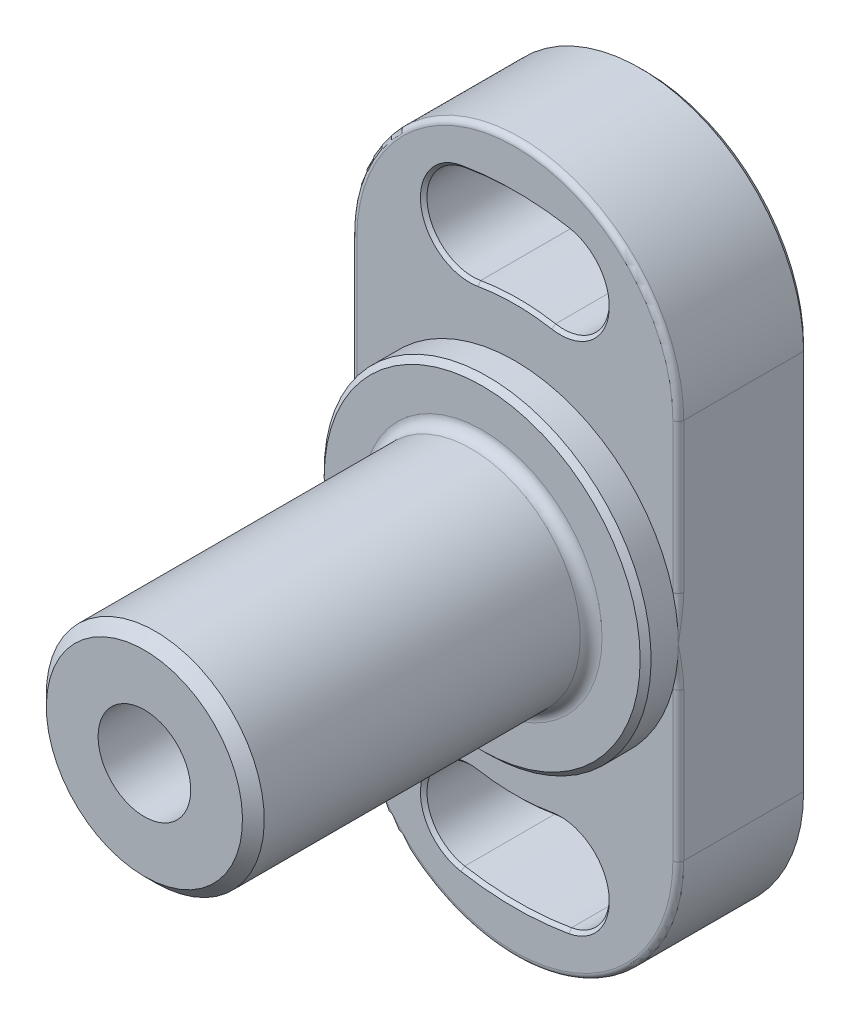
ISO-10303-21;
HEADER;
FILE_DESCRIPTION(('STEP AP214'),'2;1');
FILE_NAME('part.step','',(''),(''),'','','');
FILE_SCHEMA(('AUTOMOTIVE_DESIGN { 1 0 10303 214 1 1 1 1 }'));
ENDSEC;
DATA;
#1=APPLICATION_CONTEXT('core data for automotive mechanical design processes');
#2=APPLICATION_PROTOCOL_DEFINITION('international standard','automotive_design',2000,#1);
#3=PRODUCT_CONTEXT('',#1,'mechanical');
#4=PRODUCT('Part','Part','',(#3));
#5=PRODUCT_RELATED_PRODUCT_CATEGORY('part','',(#4));
#6=PRODUCT_DEFINITION_FORMATION('','',#4);
#7=PRODUCT_DEFINITION_CONTEXT('part definition',#1,'design');
#8=PRODUCT_DEFINITION('design','',#6,#7);
#9=PRODUCT_DEFINITION_SHAPE('','',#8);
#10=(LENGTH_UNIT() NAMED_UNIT(*) SI_UNIT(.MILLI.,.METRE.));
#11=(NAMED_UNIT(*) PLANE_ANGLE_UNIT() SI_UNIT($,.RADIAN.));
#12=(NAMED_UNIT(*) SI_UNIT($,.STERADIAN.) SOLID_ANGLE_UNIT());
#13=UNCERTAINTY_MEASURE_WITH_UNIT(LENGTH_MEASURE(1.E-05),#10,'distance_accuracy_value','');
#14=(GEOMETRIC_REPRESENTATION_CONTEXT(3) GLOBAL_UNCERTAINTY_ASSIGNED_CONTEXT((#13)) GLOBAL_UNIT_ASSIGNED_CONTEXT((#10,
#11,#12)) REPRESENTATION_CONTEXT('',''));
#15=CARTESIAN_POINT('',(0.,0.,0.));
#16=DIRECTION('',(0.,0.,1.));
#17=DIRECTION('',(1.,0.,0.));
#18=AXIS2_PLACEMENT_3D('',#15,#16,#17);
#19=CARTESIAN_POINT('',(10.,0.,46.));
#20=DIRECTION('',(0.,0.,1.));
#21=DIRECTION('',(0.,-1.,0.));
#22=AXIS2_PLACEMENT_3D('',#19,#20,#21);
#23=PLANE('',#22);
#24=CARTESIAN_POINT('',(0.,0.,46.));
#25=DIRECTION('',(0.,0.,1.));
#26=DIRECTION('',(0.,-1.,0.));
#27=AXIS2_PLACEMENT_3D('',#24,#25,#26);
#28=CIRCLE('',#27,9.);
#29=CARTESIAN_POINT('',(0.,-9.,46.));
#30=VERTEX_POINT('',#29);
#31=EDGE_CURVE('E9',#30,#30,#28,.T.);
#32=ORIENTED_EDGE('',*,*,#31,.T.);
#33=EDGE_LOOP('',(#32));
#34=FACE_BOUND('',#33,.T.);
#35=CARTESIAN_POINT('',(0.,0.,46.));
#36=DIRECTION('',(0.,0.,-1.));
#37=DIRECTION('',(0.,1.,0.));
#38=AXIS2_PLACEMENT_3D('',#35,#36,#37);
#39=CIRCLE('',#38,4.25);
#40=CARTESIAN_POINT('',(0.,4.25,46.));
#41=VERTEX_POINT('',#40);
#42=EDGE_CURVE('E235',#41,#41,#39,.T.);
#43=ORIENTED_EDGE('',*,*,#42,.T.);
#44=EDGE_LOOP('',(#43));
#45=FACE_BOUND('',#44,.T.);
#46=ADVANCED_FACE('F14',(#34,#45),#23,.T.);
#47=CARTESIAN_POINT('',(0.,0.,0.));
#48=DIRECTION('',(0.,0.,-1.));
#49=DIRECTION('',(0.,1.,0.));
#50=AXIS2_PLACEMENT_3D('',#47,#48,#49);
#51=CYLINDRICAL_SURFACE('',#50,10.);
#52=CARTESIAN_POINT('',(0.,0.,45.));
#53=DIRECTION('',(0.,0.,1.));
#54=DIRECTION('',(0.,-1.,0.));
#55=AXIS2_PLACEMENT_3D('',#52,#53,#54);
#56=CIRCLE('',#55,10.);
#57=CARTESIAN_POINT('',(0.,-10.,45.));
#58=VERTEX_POINT('',#57);
#59=EDGE_CURVE('E22',#58,#58,#56,.F.);
#60=ORIENTED_EDGE('',*,*,#59,.T.);
#61=EDGE_LOOP('',(#60));
#62=FACE_BOUND('',#61,.T.);
#63=CARTESIAN_POINT('',(0.,0.,16.));
#64=DIRECTION('',(0.,0.,1.));
#65=DIRECTION('',(0.,-1.,0.));
#66=AXIS2_PLACEMENT_3D('',#63,#64,#65);
#67=CIRCLE('',#66,10.);
#68=CARTESIAN_POINT('',(0.,-10.,16.));
#69=VERTEX_POINT('',#68);
#70=EDGE_CURVE('E627',#69,#69,#67,.T.);
#71=ORIENTED_EDGE('',*,*,#70,.T.);
#72=EDGE_LOOP('',(#71));
#73=FACE_BOUND('',#72,.T.);
#74=ADVANCED_FACE('F431',(#62,#73),#51,.T.);
#75=CARTESIAN_POINT('',(0.,0.,12.));
#76=DIRECTION('',(0.,0.,-1.));
#77=DIRECTION('',(0.,1.,0.));
#78=AXIS2_PLACEMENT_3D('',#75,#76,#77);
#79=PLANE('',#78);
#80=CARTESIAN_POINT('',(0.,0.,12.));
#81=DIRECTION('',(0.,0.,-1.));
#82=DIRECTION('',(0.,1.,0.));
#83=AXIS2_PLACEMENT_3D('',#80,#81,#82);
#84=CIRCLE('',#83,4.25);
#85=CARTESIAN_POINT('',(0.,4.25,12.));
#86=VERTEX_POINT('',#85);
#87=EDGE_CURVE('E636',#86,#86,#84,.T.);
#88=ORIENTED_EDGE('',*,*,#87,.F.);
#89=EDGE_LOOP('',(#88));
#90=FACE_BOUND('',#89,.T.);
#91=ADVANCED_FACE('F438',(#90),#79,.F.);
#92=CARTESIAN_POINT('',(0.,0.,0.));
#93=DIRECTION('',(0.,0.,-1.));
#94=DIRECTION('',(0.,1.,0.));
#95=AXIS2_PLACEMENT_3D('',#92,#93,#94);
#96=CYLINDRICAL_SURFACE('',#95,4.25);
#97=ORIENTED_EDGE('',*,*,#42,.F.);
#98=EDGE_LOOP('',(#97));
#99=FACE_BOUND('',#98,.T.);
#100=ORIENTED_EDGE('',*,*,#87,.T.);
#101=EDGE_LOOP('',(#100));
#102=FACE_BOUND('',#101,.T.);
#103=ADVANCED_FACE('F715',(#99,#102),#96,.F.);
#104=CARTESIAN_POINT('',(10.,0.,15.));
#105=DIRECTION('',(0.,0.,1.));
#106=DIRECTION('',(0.,-1.,0.));
#107=AXIS2_PLACEMENT_3D('',#104,#105,#106);
#108=PLANE('',#107);
#109=CARTESIAN_POINT('',(0.,0.,15.));
#110=DIRECTION('',(0.,0.,1.));
#111=DIRECTION('',(0.,-1.,0.));
#112=AXIS2_PLACEMENT_3D('',#109,#110,#111);
#113=CIRCLE('',#112,14.5);
#114=CARTESIAN_POINT('',(0.,-14.5,15.));
#115=VERTEX_POINT('',#114);
#116=EDGE_CURVE('E700',#115,#115,#113,.T.);
#117=ORIENTED_EDGE('',*,*,#116,.T.);
#118=EDGE_LOOP('',(#117));
#119=FACE_BOUND('',#118,.T.);
#120=CARTESIAN_POINT('',(0.,0.,15.));
#121=DIRECTION('',(0.,0.,1.));
#122=DIRECTION('',(0.,-1.,0.));
#123=AXIS2_PLACEMENT_3D('',#120,#121,#122);
#124=CIRCLE('',#123,11.);
#125=CARTESIAN_POINT('',(0.,-11.,15.));
#126=VERTEX_POINT('',#125);
#127=EDGE_CURVE('E624',#126,#126,#124,.F.);
#128=ORIENTED_EDGE('',*,*,#127,.T.);
#129=EDGE_LOOP('',(#128));
#130=FACE_BOUND('',#129,.T.);
#131=ADVANCED_FACE('F713',(#119,#130),#108,.T.);
#132=CARTESIAN_POINT('',(0.,0.,0.));
#133=DIRECTION('',(0.,0.,-1.));
#134=DIRECTION('',(0.,1.,0.));
#135=AXIS2_PLACEMENT_3D('',#132,#133,#134);
#136=CYLINDRICAL_SURFACE('',#135,15.);
#137=CARTESIAN_POINT('',(0.,0.,14.5));
#138=DIRECTION('',(0.,0.,1.));
#139=DIRECTION('',(0.,-1.,0.));
#140=AXIS2_PLACEMENT_3D('',#137,#138,#139);
#141=CIRCLE('',#140,15.);
#142=CARTESIAN_POINT('',(0.,-15.,14.5));
#143=VERTEX_POINT('',#142);
#144=EDGE_CURVE('E697',#143,#143,#141,.F.);
#145=ORIENTED_EDGE('',*,*,#144,.T.);
#146=EDGE_LOOP('',(#145));
#147=FACE_BOUND('',#146,.T.);
#148=CARTESIAN_POINT('',(0.,0.,12.));
#149=DIRECTION('',(0.,0.,-1.));
#150=DIRECTION('',(0.,1.,0.));
#151=AXIS2_PLACEMENT_3D('',#148,#149,#150);
#152=CIRCLE('',#151,15.);
#153=CARTESIAN_POINT('',(15.,0.,12.));
#154=VERTEX_POINT('',#153);
#155=CARTESIAN_POINT('',(14.5,-3.8405728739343,12.));
#156=VERTEX_POINT('',#155);
#157=EDGE_CURVE('E225',#154,#156,#152,.T.);
#158=ORIENTED_EDGE('',*,*,#157,.F.);
#159=CARTESIAN_POINT('',(14.5,3.8405728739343,12.));
#160=VERTEX_POINT('',#159);
#161=EDGE_CURVE('E228',#160,#154,#152,.T.);
#162=ORIENTED_EDGE('',*,*,#161,.F.);
#163=CARTESIAN_POINT('',(-14.5,3.8405728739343,12.));
#164=VERTEX_POINT('',#163);
#165=EDGE_CURVE('E242',#164,#160,#152,.T.);
#166=ORIENTED_EDGE('',*,*,#165,.F.);
#167=CARTESIAN_POINT('',(-15.,0.,12.));
#168=VERTEX_POINT('',#167);
#169=EDGE_CURVE('E238',#168,#164,#152,.T.);
#170=ORIENTED_EDGE('',*,*,#169,.F.);
#171=CARTESIAN_POINT('',(-14.5,-3.8405728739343,12.));
#172=VERTEX_POINT('',#171);
#173=EDGE_CURVE('E237',#172,#168,#152,.T.);
#174=ORIENTED_EDGE('',*,*,#173,.F.);
#175=EDGE_CURVE('E231',#156,#172,#152,.T.);
#176=ORIENTED_EDGE('',*,*,#175,.F.);
#177=EDGE_LOOP('',(#158,#162,#166,#170,#174,#176));
#178=FACE_BOUND('',#177,.T.);
#179=ADVANCED_FACE('F226',(#147,#178),#136,.T.);
#180=CARTESIAN_POINT('',(0.,17.5,0.));
#181=DIRECTION('',(0.,0.,1.));
#182=DIRECTION('',(0.,-1.,0.));
#183=AXIS2_PLACEMENT_3D('',#180,#181,#182);
#184=PLANE('',#183);
#185=CARTESIAN_POINT('',(4.16755626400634,23.635386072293,0.));
#186=DIRECTION('',(0.,0.,1.));
#187=DIRECTION('',(0.,-1.,0.));
#188=AXIS2_PLACEMENT_3D('',#185,#186,#187);
#189=CIRCLE('',#188,4.5);
#190=CARTESIAN_POINT('',(3.38613946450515,19.203751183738,0.));
#191=VERTEX_POINT('',#190);
#192=CARTESIAN_POINT('',(4.94897306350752,28.067020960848,0.));
#193=VERTEX_POINT('',#192);
#194=EDGE_CURVE('E37',#191,#193,#189,.T.);
#195=ORIENTED_EDGE('',*,*,#194,.T.);
#196=CARTESIAN_POINT('',(0.,0.,0.));
#197=DIRECTION('',(0.,0.,1.));
#198=DIRECTION('',(0.,-1.,0.));
#199=AXIS2_PLACEMENT_3D('',#196,#197,#198);
#200=CIRCLE('',#199,28.5);
#201=CARTESIAN_POINT('',(-4.94897306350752,28.067020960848,0.));
#202=VERTEX_POINT('',#201);
#203=EDGE_CURVE('E701',#193,#202,#200,.T.);
#204=ORIENTED_EDGE('',*,*,#203,.T.);
#205=CARTESIAN_POINT('',(-4.16755626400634,23.635386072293,0.));
#206=DIRECTION('',(0.,0.,1.));
#207=DIRECTION('',(0.,-1.,0.));
#208=AXIS2_PLACEMENT_3D('',#205,#206,#207);
#209=CIRCLE('',#208,4.5);
#210=CARTESIAN_POINT('',(-3.38613946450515,19.203751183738,0.));
#211=VERTEX_POINT('',#210);
#212=EDGE_CURVE('E674',#202,#211,#209,.T.);
#213=ORIENTED_EDGE('',*,*,#212,.T.);
#214=CARTESIAN_POINT('',(0.,0.,0.));
#215=DIRECTION('',(0.,0.,1.));
#216=DIRECTION('',(0.,-1.,0.));
#217=AXIS2_PLACEMENT_3D('',#214,#215,#216);
#218=CIRCLE('',#217,19.5);
#219=EDGE_CURVE('E1124',#211,#191,#218,.F.);
#220=ORIENTED_EDGE('',*,*,#219,.T.);
#221=EDGE_LOOP('',(#195,#204,#213,#220));
#222=FACE_BOUND('',#221,.T.);
#223=CARTESIAN_POINT('',(-4.16755626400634,-23.635386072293,0.));
#224=DIRECTION('',(0.,0.,1.));
#225=DIRECTION('',(0.,-1.,0.));
#226=AXIS2_PLACEMENT_3D('',#223,#224,#225);
#227=CIRCLE('',#226,4.5);
#228=CARTESIAN_POINT('',(-3.38613946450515,-19.203751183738,0.));
#229=VERTEX_POINT('',#228);
#230=CARTESIAN_POINT('',(-4.94897306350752,-28.067020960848,0.));
#231=VERTEX_POINT('',#230);
#232=EDGE_CURVE('E1117',#229,#231,#227,.T.);
#233=ORIENTED_EDGE('',*,*,#232,.T.);
#234=CARTESIAN_POINT('',(0.,0.,0.));
#235=DIRECTION('',(0.,0.,1.));
#236=DIRECTION('',(0.,-1.,0.));
#237=AXIS2_PLACEMENT_3D('',#234,#235,#236);
#238=CIRCLE('',#237,28.5);
#239=CARTESIAN_POINT('',(4.94897306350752,-28.067020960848,0.));
#240=VERTEX_POINT('',#239);
#241=EDGE_CURVE('E1121',#231,#240,#238,.T.);
#242=ORIENTED_EDGE('',*,*,#241,.T.);
#243=CARTESIAN_POINT('',(4.16755626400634,-23.635386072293,0.));
#244=DIRECTION('',(0.,0.,1.));
#245=DIRECTION('',(0.,-1.,0.));
#246=AXIS2_PLACEMENT_3D('',#243,#244,#245);
#247=CIRCLE('',#246,4.5);
#248=CARTESIAN_POINT('',(3.38613946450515,-19.203751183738,0.));
#249=VERTEX_POINT('',#248);
#250=EDGE_CURVE('E1119',#240,#249,#247,.T.);
#251=ORIENTED_EDGE('',*,*,#250,.T.);
#252=CARTESIAN_POINT('',(0.,0.,0.));
#253=DIRECTION('',(0.,0.,1.));
#254=DIRECTION('',(0.,-1.,0.));
#255=AXIS2_PLACEMENT_3D('',#252,#253,#254);
#256=CIRCLE('',#255,19.5);
#257=EDGE_CURVE('E1115',#249,#229,#256,.F.);
#258=ORIENTED_EDGE('',*,*,#257,.T.);
#259=EDGE_LOOP('',(#233,#242,#251,#258));
#260=FACE_BOUND('',#259,.T.);
#261=CARTESIAN_POINT('',(0.,17.5,0.));
#262=DIRECTION('',(0.,0.,1.));
#263=DIRECTION('',(0.,-1.,0.));
#264=AXIS2_PLACEMENT_3D('',#261,#262,#263);
#265=CIRCLE('',#264,14.5);
#266=CARTESIAN_POINT('',(-14.5,17.5,0.));
#267=VERTEX_POINT('',#266);
#268=CARTESIAN_POINT('',(14.5,17.5,0.));
#269=VERTEX_POINT('',#268);
#270=EDGE_CURVE('E1059',#267,#269,#265,.F.);
#271=ORIENTED_EDGE('',*,*,#270,.T.);
#272=DIRECTION('',(0.,-1.,0.));
#273=VECTOR('',#272,1.);
#274=CARTESIAN_POINT('',(14.5,17.5,0.));
#275=LINE('',#274,#273);
#276=CARTESIAN_POINT('',(14.5,-17.5,0.));
#277=VERTEX_POINT('',#276);
#278=EDGE_CURVE('E1176',#269,#277,#275,.T.);
#279=ORIENTED_EDGE('',*,*,#278,.T.);
#280=CARTESIAN_POINT('',(0.,-17.5,0.));
#281=DIRECTION('',(0.,0.,1.));
#282=DIRECTION('',(0.,-1.,0.));
#283=AXIS2_PLACEMENT_3D('',#280,#281,#282);
#284=CIRCLE('',#283,14.5);
#285=CARTESIAN_POINT('',(-14.5,-17.5,0.));
#286=VERTEX_POINT('',#285);
#287=EDGE_CURVE('E1177',#277,#286,#284,.F.);
#288=ORIENTED_EDGE('',*,*,#287,.T.);
#289=DIRECTION('',(0.,1.,0.));
#290=VECTOR('',#289,1.);
#291=CARTESIAN_POINT('',(-14.5,17.5,0.));
#292=LINE('',#291,#290);
#293=EDGE_CURVE('E576',#286,#267,#292,.T.);
#294=ORIENTED_EDGE('',*,*,#293,.T.);
#295=EDGE_LOOP('',(#271,#279,#288,#294));
#296=FACE_BOUND('',#295,.T.);
#297=ADVANCED_FACE('F272',(#222,#260,#296),#184,.F.);
#298=CARTESIAN_POINT('',(0.,0.,12.));
#299=DIRECTION('',(0.,0.,-1.));
#300=DIRECTION('',(0.,1.,0.));
#301=AXIS2_PLACEMENT_3D('',#298,#299,#300);
#302=CYLINDRICAL_SURFACE('',#301,19.8);
#303=DIRECTION('',(0.,0.,-1.));
#304=VECTOR('',#303,1.);
#305=CARTESIAN_POINT('',(-3.43823391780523,19.4991935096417,12.));
#306=LINE('',#305,#304);
#307=CARTESIAN_POINT('',(-3.43823391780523,19.4991935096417,11.7));
#308=VERTEX_POINT('',#307);
#309=CARTESIAN_POINT('',(-3.43823391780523,19.4991935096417,0.3));
#310=VERTEX_POINT('',#309);
#311=EDGE_CURVE('E657',#308,#310,#306,.T.);
#312=ORIENTED_EDGE('',*,*,#311,.F.);
#313=CARTESIAN_POINT('',(0.,0.,11.7));
#314=DIRECTION('',(0.,0.,1.));
#315=DIRECTION('',(0.,-1.,0.));
#316=AXIS2_PLACEMENT_3D('',#313,#314,#315);
#317=CIRCLE('',#316,19.8);
#318=CARTESIAN_POINT('',(3.43823391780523,19.4991935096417,11.7));
#319=VERTEX_POINT('',#318);
#320=EDGE_CURVE('E1086',#308,#319,#317,.F.);
#321=ORIENTED_EDGE('',*,*,#320,.T.);
#322=DIRECTION('',(0.,0.,-1.));
#323=VECTOR('',#322,1.);
#324=CARTESIAN_POINT('',(3.43823391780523,19.4991935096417,12.));
#325=LINE('',#324,#323);
#326=CARTESIAN_POINT('',(3.43823391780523,19.4991935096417,0.3));
#327=VERTEX_POINT('',#326);
#328=EDGE_CURVE('E654',#319,#327,#325,.T.);
#329=ORIENTED_EDGE('',*,*,#328,.T.);
#330=CARTESIAN_POINT('',(0.,0.,0.3));
#331=DIRECTION('',(0.,0.,1.));
#332=DIRECTION('',(0.,-1.,0.));
#333=AXIS2_PLACEMENT_3D('',#330,#331,#332);
#334=CIRCLE('',#333,19.8);
#335=EDGE_CURVE('E1084',#327,#310,#334,.T.);
#336=ORIENTED_EDGE('',*,*,#335,.T.);
#337=EDGE_LOOP('',(#312,#321,#329,#336));
#338=FACE_BOUND('',#337,.T.);
#339=ADVANCED_FACE('F464',(#338),#302,.T.);
#340=CARTESIAN_POINT('',(4.16755626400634,23.635386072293,12.));
#341=DIRECTION('',(0.,0.,-1.));
#342=DIRECTION('',(0.,1.,0.));
#343=AXIS2_PLACEMENT_3D('',#340,#341,#342);
#344=CYLINDRICAL_SURFACE('',#343,4.2);
#345=ORIENTED_EDGE('',*,*,#328,.F.);
#346=CARTESIAN_POINT('',(4.16755626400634,23.635386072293,11.7));
#347=DIRECTION('',(0.,0.,1.));
#348=DIRECTION('',(0.,-1.,0.));
#349=AXIS2_PLACEMENT_3D('',#346,#347,#348);
#350=CIRCLE('',#349,4.2);
#351=CARTESIAN_POINT('',(4.89687861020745,27.7715786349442,11.7));
#352=VERTEX_POINT('',#351);
#353=EDGE_CURVE('E1082',#319,#352,#350,.T.);
#354=ORIENTED_EDGE('',*,*,#353,.T.);
#355=DIRECTION('',(0.,0.,-1.));
#356=VECTOR('',#355,1.);
#357=CARTESIAN_POINT('',(4.89687861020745,27.7715786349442,12.));
#358=LINE('',#357,#356);
#359=CARTESIAN_POINT('',(4.89687861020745,27.7715786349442,0.3));
#360=VERTEX_POINT('',#359);
#361=EDGE_CURVE('E651',#352,#360,#358,.T.);
#362=ORIENTED_EDGE('',*,*,#361,.T.);
#363=CARTESIAN_POINT('',(4.16755626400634,23.635386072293,0.3));
#364=DIRECTION('',(0.,0.,1.));
#365=DIRECTION('',(0.,-1.,0.));
#366=AXIS2_PLACEMENT_3D('',#363,#364,#365);
#367=CIRCLE('',#366,4.2);
#368=EDGE_CURVE('E1080',#360,#327,#367,.F.);
#369=ORIENTED_EDGE('',*,*,#368,.T.);
#370=EDGE_LOOP('',(#345,#354,#362,#369));
#371=FACE_BOUND('',#370,.T.);
#372=ADVANCED_FACE('F460',(#371),#344,.F.);
#373=CARTESIAN_POINT('',(0.,0.,12.));
#374=DIRECTION('',(0.,0.,-1.));
#375=DIRECTION('',(0.,1.,0.));
#376=AXIS2_PLACEMENT_3D('',#373,#374,#375);
#377=CYLINDRICAL_SURFACE('',#376,28.2);
#378=ORIENTED_EDGE('',*,*,#361,.F.);
#379=CARTESIAN_POINT('',(0.,0.,11.7));
#380=DIRECTION('',(0.,0.,1.));
#381=DIRECTION('',(0.,-1.,0.));
#382=AXIS2_PLACEMENT_3D('',#379,#380,#381);
#383=CIRCLE('',#382,28.2);
#384=CARTESIAN_POINT('',(-4.89687861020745,27.7715786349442,11.7));
#385=VERTEX_POINT('',#384);
#386=EDGE_CURVE('E666',#352,#385,#383,.T.);
#387=ORIENTED_EDGE('',*,*,#386,.T.);
#388=DIRECTION('',(0.,0.,-1.));
#389=VECTOR('',#388,1.);
#390=CARTESIAN_POINT('',(-4.89687861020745,27.7715786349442,12.));
#391=LINE('',#390,#389);
#392=CARTESIAN_POINT('',(-4.89687861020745,27.7715786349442,0.3));
#393=VERTEX_POINT('',#392);
#394=EDGE_CURVE('E618',#385,#393,#391,.T.);
#395=ORIENTED_EDGE('',*,*,#394,.T.);
#396=CARTESIAN_POINT('',(0.,0.,0.3));
#397=DIRECTION('',(0.,0.,1.));
#398=DIRECTION('',(0.,-1.,0.));
#399=AXIS2_PLACEMENT_3D('',#396,#397,#398);
#400=CIRCLE('',#399,28.2);
#401=EDGE_CURVE('E664',#393,#360,#400,.F.);
#402=ORIENTED_EDGE('',*,*,#401,.T.);
#403=EDGE_LOOP('',(#378,#387,#395,#402));
#404=FACE_BOUND('',#403,.T.);
#405=ADVANCED_FACE('F463',(#404),#377,.F.);
#406=CARTESIAN_POINT('',(-4.16755626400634,23.635386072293,12.));
#407=DIRECTION('',(0.,0.,-1.));
#408=DIRECTION('',(0.,1.,0.));
#409=AXIS2_PLACEMENT_3D('',#406,#407,#408);
#410=CYLINDRICAL_SURFACE('',#409,4.2);
#411=ORIENTED_EDGE('',*,*,#394,.F.);
#412=CARTESIAN_POINT('',(-4.16755626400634,23.635386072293,11.7));
#413=DIRECTION('',(0.,0.,1.));
#414=DIRECTION('',(0.,-1.,0.));
#415=AXIS2_PLACEMENT_3D('',#412,#413,#414);
#416=CIRCLE('',#415,4.2);
#417=EDGE_CURVE('E1078',#385,#308,#416,.T.);
#418=ORIENTED_EDGE('',*,*,#417,.T.);
#419=ORIENTED_EDGE('',*,*,#311,.T.);
#420=CARTESIAN_POINT('',(-4.16755626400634,23.635386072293,0.3));
#421=DIRECTION('',(0.,0.,1.));
#422=DIRECTION('',(0.,-1.,0.));
#423=AXIS2_PLACEMENT_3D('',#420,#421,#422);
#424=CIRCLE('',#423,4.2);
#425=EDGE_CURVE('E673',#310,#393,#424,.F.);
#426=ORIENTED_EDGE('',*,*,#425,.T.);
#427=EDGE_LOOP('',(#411,#418,#419,#426));
#428=FACE_BOUND('',#427,.T.);
#429=ADVANCED_FACE('F469',(#428),#410,.F.);
#430=CARTESIAN_POINT('',(0.,17.5,12.));
#431=DIRECTION('',(0.,0.,-1.));
#432=DIRECTION('',(0.,1.,0.));
#433=AXIS2_PLACEMENT_3D('',#430,#431,#432);
#434=CYLINDRICAL_SURFACE('',#433,15.);
#435=DIRECTION('',(0.,0.,-1.));
#436=VECTOR('',#435,1.);
#437=CARTESIAN_POINT('',(15.,17.5,12.));
#438=LINE('',#437,#436);
#439=CARTESIAN_POINT('',(15.,17.5,11.5));
#440=VERTEX_POINT('',#439);
#441=CARTESIAN_POINT('',(15.,17.5,0.499999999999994));
#442=VERTEX_POINT('',#441);
#443=EDGE_CURVE('E614',#440,#442,#438,.T.);
#444=ORIENTED_EDGE('',*,*,#443,.T.);
#445=CARTESIAN_POINT('',(0.,17.5,0.499999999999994));
#446=DIRECTION('',(0.,0.,1.));
#447=DIRECTION('',(0.,-1.,0.));
#448=AXIS2_PLACEMENT_3D('',#445,#446,#447);
#449=CIRCLE('',#448,15.);
#450=CARTESIAN_POINT('',(-15.,17.5,0.499999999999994));
#451=VERTEX_POINT('',#450);
#452=EDGE_CURVE('E1058',#442,#451,#449,.T.);
#453=ORIENTED_EDGE('',*,*,#452,.T.);
#454=DIRECTION('',(0.,0.,-1.));
#455=VECTOR('',#454,1.);
#456=CARTESIAN_POINT('',(-15.,17.5,12.));
#457=LINE('',#456,#455);
#458=CARTESIAN_POINT('',(-15.,17.5,11.5));
#459=VERTEX_POINT('',#458);
#460=EDGE_CURVE('E616',#459,#451,#457,.T.);
#461=ORIENTED_EDGE('',*,*,#460,.F.);
#462=CARTESIAN_POINT('',(0.,17.5,11.5));
#463=DIRECTION('',(0.,0.,1.));
#464=DIRECTION('',(0.,-1.,0.));
#465=AXIS2_PLACEMENT_3D('',#462,#463,#464);
#466=CIRCLE('',#465,15.);
#467=EDGE_CURVE('E530',#459,#440,#466,.F.);
#468=ORIENTED_EDGE('',*,*,#467,.T.);
#469=EDGE_LOOP('',(#444,#453,#461,#468));
#470=FACE_BOUND('',#469,.T.);
#471=ADVANCED_FACE('F452',(#470),#434,.T.);
#472=CARTESIAN_POINT('',(-4.16755626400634,-23.635386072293,12.));
#473=DIRECTION('',(0.,0.,-1.));
#474=DIRECTION('',(0.,1.,0.));
#475=AXIS2_PLACEMENT_3D('',#472,#473,#474);
#476=CYLINDRICAL_SURFACE('',#475,4.2);
#477=DIRECTION('',(0.,0.,-1.));
#478=VECTOR('',#477,1.);
#479=CARTESIAN_POINT('',(-3.43823391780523,-19.4991935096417,12.));
#480=LINE('',#479,#478);
#481=CARTESIAN_POINT('',(-3.43823391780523,-19.4991935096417,11.7));
#482=VERTEX_POINT('',#481);
#483=CARTESIAN_POINT('',(-3.43823391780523,-19.4991935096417,0.3));
#484=VERTEX_POINT('',#483);
#485=EDGE_CURVE('E645',#482,#484,#480,.T.);
#486=ORIENTED_EDGE('',*,*,#485,.F.);
#487=CARTESIAN_POINT('',(-4.16755626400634,-23.635386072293,11.7));
#488=DIRECTION('',(0.,0.,1.));
#489=DIRECTION('',(0.,-1.,0.));
#490=AXIS2_PLACEMENT_3D('',#487,#488,#489);
#491=CIRCLE('',#490,4.2);
#492=CARTESIAN_POINT('',(-4.89687861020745,-27.7715786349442,11.7));
#493=VERTEX_POINT('',#492);
#494=EDGE_CURVE('E1109',#482,#493,#491,.T.);
#495=ORIENTED_EDGE('',*,*,#494,.T.);
#496=DIRECTION('',(0.,0.,-1.));
#497=VECTOR('',#496,1.);
#498=CARTESIAN_POINT('',(-4.89687861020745,-27.7715786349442,12.));
#499=LINE('',#498,#497);
#500=CARTESIAN_POINT('',(-4.89687861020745,-27.7715786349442,0.3));
#501=VERTEX_POINT('',#500);
#502=EDGE_CURVE('E642',#493,#501,#499,.T.);
#503=ORIENTED_EDGE('',*,*,#502,.T.);
#504=CARTESIAN_POINT('',(-4.16755626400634,-23.635386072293,0.3));
#505=DIRECTION('',(0.,0.,1.));
#506=DIRECTION('',(0.,-1.,0.));
#507=AXIS2_PLACEMENT_3D('',#504,#505,#506);
#508=CIRCLE('',#507,4.2);
#509=EDGE_CURVE('E1107',#501,#484,#508,.F.);
#510=ORIENTED_EDGE('',*,*,#509,.T.);
#511=EDGE_LOOP('',(#486,#495,#503,#510));
#512=FACE_BOUND('',#511,.T.);
#513=ADVANCED_FACE('F448',(#512),#476,.F.);
#514=CARTESIAN_POINT('',(0.,0.,12.));
#515=DIRECTION('',(0.,0.,-1.));
#516=DIRECTION('',(0.,1.,0.));
#517=AXIS2_PLACEMENT_3D('',#514,#515,#516);
#518=CYLINDRICAL_SURFACE('',#517,28.2);
#519=ORIENTED_EDGE('',*,*,#502,.F.);
#520=CARTESIAN_POINT('',(0.,0.,11.7));
#521=DIRECTION('',(0.,0.,1.));
#522=DIRECTION('',(0.,-1.,0.));
#523=AXIS2_PLACEMENT_3D('',#520,#521,#522);
#524=CIRCLE('',#523,28.2);
#525=CARTESIAN_POINT('',(4.89687861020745,-27.7715786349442,11.7));
#526=VERTEX_POINT('',#525);
#527=EDGE_CURVE('E1091',#493,#526,#524,.T.);
#528=ORIENTED_EDGE('',*,*,#527,.T.);
#529=DIRECTION('',(0.,0.,-1.));
#530=VECTOR('',#529,1.);
#531=CARTESIAN_POINT('',(4.89687861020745,-27.7715786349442,12.));
#532=LINE('',#531,#530);
#533=CARTESIAN_POINT('',(4.89687861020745,-27.7715786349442,0.3));
#534=VERTEX_POINT('',#533);
#535=EDGE_CURVE('E639',#526,#534,#532,.T.);
#536=ORIENTED_EDGE('',*,*,#535,.T.);
#537=CARTESIAN_POINT('',(0.,0.,0.3));
#538=DIRECTION('',(0.,0.,1.));
#539=DIRECTION('',(0.,-1.,0.));
#540=AXIS2_PLACEMENT_3D('',#537,#538,#539);
#541=CIRCLE('',#540,28.2);
#542=EDGE_CURVE('E1088',#534,#501,#541,.F.);
#543=ORIENTED_EDGE('',*,*,#542,.T.);
#544=EDGE_LOOP('',(#519,#528,#536,#543));
#545=FACE_BOUND('',#544,.T.);
#546=ADVANCED_FACE('F444',(#545),#518,.F.);
#547=CARTESIAN_POINT('',(4.16755626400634,-23.635386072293,12.));
#548=DIRECTION('',(0.,0.,-1.));
#549=DIRECTION('',(0.,1.,0.));
#550=AXIS2_PLACEMENT_3D('',#547,#548,#549);
#551=CYLINDRICAL_SURFACE('',#550,4.2);
#552=ORIENTED_EDGE('',*,*,#535,.F.);
#553=CARTESIAN_POINT('',(4.16755626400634,-23.635386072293,11.7));
#554=DIRECTION('',(0.,0.,1.));
#555=DIRECTION('',(0.,-1.,0.));
#556=AXIS2_PLACEMENT_3D('',#553,#554,#555);
#557=CIRCLE('',#556,4.2);
#558=CARTESIAN_POINT('',(3.43823391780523,-19.4991935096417,11.7));
#559=VERTEX_POINT('',#558);
#560=EDGE_CURVE('E1105',#526,#559,#557,.T.);
#561=ORIENTED_EDGE('',*,*,#560,.T.);
#562=DIRECTION('',(0.,0.,-1.));
#563=VECTOR('',#562,1.);
#564=CARTESIAN_POINT('',(3.43823391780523,-19.4991935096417,12.));
#565=LINE('',#564,#563);
#566=CARTESIAN_POINT('',(3.43823391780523,-19.4991935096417,0.3));
#567=VERTEX_POINT('',#566);
#568=EDGE_CURVE('E648',#559,#567,#565,.T.);
#569=ORIENTED_EDGE('',*,*,#568,.T.);
#570=CARTESIAN_POINT('',(4.16755626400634,-23.635386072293,0.3));
#571=DIRECTION('',(0.,0.,1.));
#572=DIRECTION('',(0.,-1.,0.));
#573=AXIS2_PLACEMENT_3D('',#570,#571,#572);
#574=CIRCLE('',#573,4.2);
#575=EDGE_CURVE('E1103',#567,#534,#574,.F.);
#576=ORIENTED_EDGE('',*,*,#575,.T.);
#577=EDGE_LOOP('',(#552,#561,#569,#576));
#578=FACE_BOUND('',#577,.T.);
#579=ADVANCED_FACE('F447',(#578),#551,.F.);
#580=CARTESIAN_POINT('',(0.,0.,12.));
#581=DIRECTION('',(0.,0.,-1.));
#582=DIRECTION('',(0.,1.,0.));
#583=AXIS2_PLACEMENT_3D('',#580,#581,#582);
#584=CYLINDRICAL_SURFACE('',#583,19.8);
#585=ORIENTED_EDGE('',*,*,#568,.F.);
#586=CARTESIAN_POINT('',(0.,0.,11.7));
#587=DIRECTION('',(0.,0.,1.));
#588=DIRECTION('',(0.,-1.,0.));
#589=AXIS2_PLACEMENT_3D('',#586,#587,#588);
#590=CIRCLE('',#589,19.8);
#591=EDGE_CURVE('E1113',#559,#482,#590,.F.);
#592=ORIENTED_EDGE('',*,*,#591,.T.);
#593=ORIENTED_EDGE('',*,*,#485,.T.);
#594=CARTESIAN_POINT('',(0.,0.,0.3));
#595=DIRECTION('',(0.,0.,1.));
#596=DIRECTION('',(0.,-1.,0.));
#597=AXIS2_PLACEMENT_3D('',#594,#595,#596);
#598=CIRCLE('',#597,19.8);
#599=EDGE_CURVE('E1111',#484,#567,#598,.T.);
#600=ORIENTED_EDGE('',*,*,#599,.T.);
#601=EDGE_LOOP('',(#585,#592,#593,#600));
#602=FACE_BOUND('',#601,.T.);
#603=ADVANCED_FACE('F271',(#602),#584,.T.);
#604=CARTESIAN_POINT('',(15.,17.5,12.));
#605=DIRECTION('',(-1.,0.,0.));
#606=DIRECTION('',(0.,-1.,0.));
#607=AXIS2_PLACEMENT_3D('',#604,#605,#606);
#608=PLANE('',#607);
#609=DIRECTION('',(0.,0.,-1.));
#610=VECTOR('',#609,1.);
#611=CARTESIAN_POINT('',(15.,-17.5,12.));
#612=LINE('',#611,#610);
#613=CARTESIAN_POINT('',(15.,-17.5,11.5));
#614=VERTEX_POINT('',#613);
#615=CARTESIAN_POINT('',(15.,-17.5,0.499999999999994));
#616=VERTEX_POINT('',#615);
#617=EDGE_CURVE('E607',#614,#616,#612,.T.);
#618=ORIENTED_EDGE('',*,*,#617,.T.);
#619=DIRECTION('',(0.,1.,0.));
#620=VECTOR('',#619,1.);
#621=CARTESIAN_POINT('',(15.,17.5,0.499999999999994));
#622=LINE('',#621,#620);
#623=EDGE_CURVE('E336',#616,#442,#622,.T.);
#624=ORIENTED_EDGE('',*,*,#623,.T.);
#625=ORIENTED_EDGE('',*,*,#443,.F.);
#626=DIRECTION('',(0.,1.,0.));
#627=VECTOR('',#626,1.);
#628=CARTESIAN_POINT('',(15.,0.,11.5));
#629=LINE('',#628,#627);
#630=CARTESIAN_POINT('',(15.,3.8405728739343,11.5));
#631=VERTEX_POINT('',#630);
#632=EDGE_CURVE('E216',#440,#631,#629,.F.);
#633=ORIENTED_EDGE('',*,*,#632,.T.);
#634=CARTESIAN_POINT('',(14.185673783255,4.87510608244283,12.));
#635=CARTESIAN_POINT('',(14.4308988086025,4.82003659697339,12.1904278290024));
#636=CARTESIAN_POINT('',(14.7154494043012,4.85778301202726,12.0599024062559));
#637=CARTESIAN_POINT('',(15.,4.89552942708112,11.9293769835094));
#638=CARTESIAN_POINT('',(15.,4.98312868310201,11.6264626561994));
#639=CARTESIAN_POINT('',(14.1999027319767,4.83370691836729,12.));
#640=CARTESIAN_POINT('',(14.4472952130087,4.78697960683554,12.1792969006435));
#641=CARTESIAN_POINT('',(14.7236897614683,4.82202754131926,12.0454610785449));
#642=CARTESIAN_POINT('',(15.,4.85749880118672,11.9117765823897));
#643=CARTESIAN_POINT('',(15.,4.9358126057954,11.6128365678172));
#644=CARTESIAN_POINT('',(14.2141201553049,4.79174292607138,12.));
#645=CARTESIAN_POINT('',(14.4628891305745,4.75158482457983,12.1683482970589));
#646=CARTESIAN_POINT('',(14.7314806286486,4.7842958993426,12.0318535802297));
#647=CARTESIAN_POINT('',(15.,4.81740548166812,11.8954843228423));
#648=CARTESIAN_POINT('',(15.,4.88806808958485,11.6008401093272));
#649=CARTESIAN_POINT('',(14.2424242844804,4.70694532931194,12.));
#650=CARTESIAN_POINT('',(14.4925191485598,4.67765986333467,12.1471868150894));
#651=CARTESIAN_POINT('',(14.7462977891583,4.70595521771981,12.0062663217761));
#652=CARTESIAN_POINT('',(15.,4.73463769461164,11.8654769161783));
#653=CARTESIAN_POINT('',(15.,4.79202360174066,11.5795570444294));
#654=CARTESIAN_POINT('',(14.2565111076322,4.66411264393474,12.));
#655=CARTESIAN_POINT('',(14.5065891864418,4.6391216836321,12.1369538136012));
#656=CARTESIAN_POINT('',(14.7533248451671,4.66534911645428,11.9942849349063));
#657=CARTESIAN_POINT('',(15.,4.69194412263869,11.8517164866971));
#658=CARTESIAN_POINT('',(15.,4.74372423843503,11.57026771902));
#659=CARTESIAN_POINT('',(14.2844323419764,4.57788643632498,12.));
#660=CARTESIAN_POINT('',(14.5334302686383,4.56006692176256,12.1174390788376));
#661=CARTESIAN_POINT('',(14.7667441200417,4.5823862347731,11.9719156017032));
#662=CARTESIAN_POINT('',(15.,4.60507035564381,11.8264891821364));
#663=CARTESIAN_POINT('',(15.,4.64692445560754,11.5538496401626));
#664=CARTESIAN_POINT('',(14.2982673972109,4.53449504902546,12.));
#665=CARTESIAN_POINT('',(14.5462279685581,4.51954018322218,12.1081378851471));
#666=CARTESIAN_POINT('',(14.7731382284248,4.54003523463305,11.9615228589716));
#667=CARTESIAN_POINT('',(15.,4.56087090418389,11.8149846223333));
#668=CARTESIAN_POINT('',(15.,4.59842511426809,11.5467143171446));
#669=CARTESIAN_POINT('',(14.3256841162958,4.44711949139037,12.));
#670=CARTESIAN_POINT('',(14.5707712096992,4.43691362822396,12.0904385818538));
#671=CARTESIAN_POINT('',(14.7854096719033,4.4539478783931,11.9421401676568));
#672=CARTESIAN_POINT('',(15.,4.47131934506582,11.7939175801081));
#673=CARTESIAN_POINT('',(15.,4.50118580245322,11.5342294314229));
#674=CARTESIAN_POINT('',(14.339265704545,4.40313515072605,12.));
#675=CARTESIAN_POINT('',(14.582533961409,4.3947943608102,12.0820269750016));
#676=CARTESIAN_POINT('',(14.7912868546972,4.41021111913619,11.9331506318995));
#677=CARTESIAN_POINT('',(15.,4.42594200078,11.784332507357));
#678=CARTESIAN_POINT('',(15.,4.45244576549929,11.528880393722));
#679=CARTESIAN_POINT('',(14.3793254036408,4.2712282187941,12.));
#680=CARTESIAN_POINT('',(14.6161467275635,4.26789348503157,12.0583366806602));
#681=CARTESIAN_POINT('',(14.8081521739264,4.27829233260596,11.9082386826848));
#682=CARTESIAN_POINT('',(15.,4.28991775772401,11.7583744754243));
#683=CARTESIAN_POINT('',(15.,4.30689436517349,11.5151876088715));
#684=CARTESIAN_POINT('',(14.4053721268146,4.1825694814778,12.));
#685=CARTESIAN_POINT('',(14.6368699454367,4.18084594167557,12.0441973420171));
#686=CARTESIAN_POINT('',(14.8184923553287,4.18863761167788,11.8941760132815));
#687=CARTESIAN_POINT('',(15.,4.19749690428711,11.7442986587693));
#688=CARTESIAN_POINT('',(15.,4.20987372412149,11.509060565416));
#689=CARTESIAN_POINT('',(14.4561333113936,4.0036081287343,12.));
#690=CARTESIAN_POINT('',(14.675539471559,4.00386221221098,12.0189870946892));
#691=CARTESIAN_POINT('',(14.8378251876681,4.00689595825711,11.8701311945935));
#692=CARTESIAN_POINT('',(15.,4.01098340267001,11.721412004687));
#693=CARTESIAN_POINT('',(15.,4.01558600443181,11.5013556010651));
#694=CARTESIAN_POINT('',(14.4808464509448,3.91330399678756,12.));
#695=CARTESIAN_POINT('',(14.6935508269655,3.91379350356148,12.0078604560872));
#696=CARTESIAN_POINT('',(14.8468165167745,3.91480674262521,11.8601530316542));
#697=CARTESIAN_POINT('',(15.,3.91673656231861,11.712524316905));
#698=CARTESIAN_POINT('',(15.,3.91831877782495,11.4997821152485));
#699=CARTESIAN_POINT('',(14.5440442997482,3.6734795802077,12.));
#700=CARTESIAN_POINT('',(14.7378916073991,3.67459584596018,11.9821196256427));
#701=CARTESIAN_POINT('',(14.8690574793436,3.67002882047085,11.838314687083));
#702=CARTESIAN_POINT('',(15.,3.6679008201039,11.6947323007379));
#703=CARTESIAN_POINT('',(15.,3.66192628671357,11.5004219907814));
#704=CARTESIAN_POINT('',(14.5812893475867,3.52283182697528,12.));
#705=CARTESIAN_POINT('',(14.7626122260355,3.52272499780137,11.9695190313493));
#706=CARTESIAN_POINT('',(14.8813776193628,3.51605500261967,11.8292949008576));
#707=CARTESIAN_POINT('',(15.,3.51134329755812,11.6891467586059));
#708=CARTESIAN_POINT('',(15.,3.50281056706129,11.5056809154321));
#709=CARTESIAN_POINT('',(14.6514491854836,3.2186070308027,12.));
#710=CARTESIAN_POINT('',(14.807292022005,3.2161749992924,11.9499722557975));
#711=CARTESIAN_POINT('',(14.903714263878,3.20589367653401,11.8180832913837));
#712=CARTESIAN_POINT('',(15.,3.197535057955,11.6862586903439));
#713=CARTESIAN_POINT('',(15.,3.18495584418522,11.5232619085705));
#714=CARTESIAN_POINT('',(14.684362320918,3.06502889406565,12.));
#715=CARTESIAN_POINT('',(14.8273706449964,3.06110184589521,11.9429309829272));
#716=CARTESIAN_POINT('',(14.9137298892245,3.04970534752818,11.8158940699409));
#717=CARTESIAN_POINT('',(15.,3.03985484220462,11.6888527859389));
#718=CARTESIAN_POINT('',(15.,3.02621700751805,11.5355866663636));
#719=CARTESIAN_POINT('',(14.7456026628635,2.75538011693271,12.));
#720=CARTESIAN_POINT('',(14.8635844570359,2.74912309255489,11.9332924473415));
#721=CARTESIAN_POINT('',(14.931836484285,2.73595159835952,11.8167708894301));
#722=CARTESIAN_POINT('',(15.,2.72431238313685,11.7002450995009));
#723=CARTESIAN_POINT('',(15.,2.70915717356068,11.5655812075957));
#724=CARTESIAN_POINT('',(14.7739270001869,2.5993079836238,12.));
#725=CARTESIAN_POINT('',(14.8797958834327,2.59188688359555,11.9306439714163));
#726=CARTESIAN_POINT('',(14.9399262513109,2.57838538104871,11.8198402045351));
#727=CARTESIAN_POINT('',(15.,2.56610052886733,11.7089994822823));
#728=CARTESIAN_POINT('',(15.,2.55083649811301,11.5832543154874));
#729=CARTESIAN_POINT('',(14.8257645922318,2.28518355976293,12.));
#730=CARTESIAN_POINT('',(14.9087752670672,2.27629701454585,11.9288211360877));
#731=CARTESIAN_POINT('',(14.9544147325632,2.26247177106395,11.8300229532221));
#732=CARTESIAN_POINT('',(15.,2.24984605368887,11.7311838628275));
#733=CARTESIAN_POINT('',(15.,2.23469494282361,11.6226569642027));
#734=CARTESIAN_POINT('',(14.8492773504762,2.12713106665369,12.));
#735=CARTESIAN_POINT('',(14.9215959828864,2.11765812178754,11.9296190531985));
#736=CARTESIAN_POINT('',(14.9608132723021,2.10412429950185,11.8371368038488));
#737=CARTESIAN_POINT('',(15.,2.0915079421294,11.7445994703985));
#738=CARTESIAN_POINT('',(15.,2.07687411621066,11.6443869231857));
#739=CARTESIAN_POINT('',(14.9126243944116,1.64850858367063,12.));
#740=CARTESIAN_POINT('',(14.9554554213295,1.64005426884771,11.9359836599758));
#741=CARTESIAN_POINT('',(14.9777963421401,1.62629223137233,11.8631339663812));
#742=CARTESIAN_POINT('',(15.,1.61627727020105,11.7900907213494));
#743=CARTESIAN_POINT('',(15.,1.60199575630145,11.7143989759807));
#744=CARTESIAN_POINT('',(14.944855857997,1.32553957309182,12.));
#745=CARTESIAN_POINT('',(14.9720715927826,1.31713375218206,11.9455352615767));
#746=CARTESIAN_POINT('',(14.9860529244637,1.30611016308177,11.8866390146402));
#747=CARTESIAN_POINT('',(15.,1.29690527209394,11.8276060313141));
#748=CARTESIAN_POINT('',(15.,1.28562567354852,11.7672750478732));
#749=CARTESIAN_POINT('',(14.9882629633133,0.676558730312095,12.));
#750=CARTESIAN_POINT('',(14.9941421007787,0.671823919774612,11.9696596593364));
#751=CARTESIAN_POINT('',(14.9970846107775,0.665317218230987,11.9393427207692));
#752=CARTESIAN_POINT('',(15.,0.660555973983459,11.9088694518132));
#753=CARTESIAN_POINT('',(15.,0.6540603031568,11.8786148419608));
#754=CARTESIAN_POINT('',(14.9994473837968,0.350548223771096,12.));
#755=CARTESIAN_POINT('',(14.9997238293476,0.347649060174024,11.9842692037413));
#756=CARTESIAN_POINT('',(14.9998620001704,0.344706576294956,11.9685389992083));
#757=CARTESIAN_POINT('',(15.,0.341806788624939,11.9528049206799));
#758=CARTESIAN_POINT('',(15.,0.338864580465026,11.9370762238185));
#759=CARTESIAN_POINT('',(14.9999866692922,0.020412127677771,12.));
#760=CARTESIAN_POINT('',(14.99999333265,0.0202420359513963,11.9990839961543));
#761=CARTESIAN_POINT('',(14.9999966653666,0.0200719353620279,11.9981679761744));
#762=CARTESIAN_POINT('',(15.,0.0199018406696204,11.9972519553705));
#763=CARTESIAN_POINT('',(15.,0.0197317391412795,11.9963359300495));
#764=CARTESIAN_POINT('',(14.9999916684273,0.0163293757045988,12.));
#765=CARTESIAN_POINT('',(14.9999958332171,0.0161933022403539,11.9992672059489));
#766=CARTESIAN_POINT('',(14.9999979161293,0.0160572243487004,11.9985344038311));
#767=CARTESIAN_POINT('',(15.,0.0159211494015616,11.9978016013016));
#768=CARTESIAN_POINT('',(15.,0.0157850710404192,11.9970687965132));
#769=CARTESIAN_POINT('',(14.9999983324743,0.00816441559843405,12.));
#770=CARTESIAN_POINT('',(14.9999991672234,0.00809638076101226,11.9996336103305));
#771=CARTESIAN_POINT('',(14.9999995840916,0.00802834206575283,11.9992672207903));
#772=CARTESIAN_POINT('',(15.,0.00796030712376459,11.9989008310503));
#773=CARTESIAN_POINT('',(15.,0.00789226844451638,11.9985344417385));
#774=CARTESIAN_POINT('',(14.9999999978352,0.00408220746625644,12.));
#775=CARTESIAN_POINT('',(15.0000000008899,0.00404818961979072,11.9998168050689));
#776=CARTESIAN_POINT('',(15.0000000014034,0.00401417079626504,11.9996336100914));
#777=CARTESIAN_POINT('',(15.,0.00398015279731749,11.9994504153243));
#778=CARTESIAN_POINT('',(15.,0.00394613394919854,11.9992672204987));
#779=CARTESIAN_POINT('',(15.,0.,12.));
#780=CARTESIAN_POINT('',(15.,0.,12.));
#781=CARTESIAN_POINT('',(15.,0.,12.));
#782=CARTESIAN_POINT('',(15.,0.,12.));
#783=CARTESIAN_POINT('',(15.,0.,12.));
#784=(BOUNDED_SURFACE() B_SPLINE_SURFACE(3,2,((#634,#635,#636,#637,#638),(#639,#640,#641,#642,
#643),(#644,#645,#646,#647,#648),(#649,#650,#651,#652,#653),(#654,#655,#656,#657,#658),(#659,
#660,#661,#662,#663),(#664,#665,#666,#667,#668),(#669,#670,#671,#672,#673),(#674,#675,#676,#677,
#678),(#679,#680,#681,#682,#683),(#684,#685,#686,#687,#688),(#689,#690,#691,#692,#693),(#694,
#695,#696,#697,#698),(#699,#700,#701,#702,#703),(#704,#705,#706,#707,#708),(#709,#710,#711,#712,
#713),(#714,#715,#716,#717,#718),(#719,#720,#721,#722,#723),(#724,#725,#726,#727,#728),(#729,
#730,#731,#732,#733),(#734,#735,#736,#737,#738),(#739,#740,#741,#742,#743),(#744,#745,#746,#747,
#748),(#749,#750,#751,#752,#753),(#754,#755,#756,#757,#758),(#759,#760,#761,#762,#763),(#764,
#765,#766,#767,#768),(#769,#770,#771,#772,#773),(#774,#775,#776,#777,#778),(#779,#780,#781,#782,
#783)),.UNSPECIFIED.,.F.,.F.,.F.) B_SPLINE_SURFACE_WITH_KNOTS((4,2,2,2,2,2,2,2,2,2,2,2,2,2,4),
(3,2,3),(0.,0.14763163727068,0.295114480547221,0.442142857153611,0.589214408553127,
0.880696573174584,1.17246254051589,1.6498249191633,2.1273691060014,2.60521073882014,
3.08310165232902,4.0452252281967,5.00694741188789,5.01898981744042,5.0310306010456),(0.,0.5,1.),
.UNSPECIFIED.) GEOMETRIC_REPRESENTATION_ITEM() RATIONAL_B_SPLINE_SURFACE(((1.,0.84584242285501,
1.,0.84584242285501,1.),(1.,0.85071187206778,1.,0.85071187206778,1.),(1.,0.855276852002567,1.,
0.855276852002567,1.),(1.,0.863896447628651,1.,0.863896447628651,1.),(1.,0.867951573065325,1.,
0.867951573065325,1.),(1.,0.875647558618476,1.,0.875647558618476,1.),(1.,0.879289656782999,1.,
0.879289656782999,1.),(1.,0.88624023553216,1.,0.88624023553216,1.),(1.,0.88954861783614,1.,
0.88954861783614,1.),(1.,0.898994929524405,1.,0.898994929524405,1.),(1.,0.904721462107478,1.,
0.904721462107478,1.),(1.,0.915343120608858,1.,0.915343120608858,1.),(1.,0.920237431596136,1.,
0.920237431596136,1.),(1.,0.932262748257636,1.,0.932262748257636,1.),(1.,0.938836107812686,1.,
0.938836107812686,1.),(1.,0.950656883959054,1.,0.950656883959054,1.),(1.,0.955903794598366,1.,
0.955903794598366,1.),(1.,0.965328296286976,1.,0.965328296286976,1.),(1.,0.969505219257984,1.,
0.969505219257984,1.),(1.,0.976948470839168,1.,0.976948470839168,1.),(1.,0.98021470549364,1.,
0.98021470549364,1.),(1.,0.988853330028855,1.,0.988853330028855,1.),(1.,0.993006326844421,1.,
0.993006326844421,1.),(1.,0.998544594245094,1.,0.998544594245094,1.),(1.,0.999931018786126,1.,
0.999931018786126,1.),(1.,0.999998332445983,1.,0.999998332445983,1.),(1.,0.999998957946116,1.,
0.999998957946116,1.),(1.,0.999999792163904,1.,0.999999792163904,1.),(1.,1.00000000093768,1.,
1.00000000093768,1.),(1.,1.,1.,1.,1.))) REPRESENTATION_ITEM('') SURFACE());
#785=CARTESIAN_POINT('',(15.,4.98312868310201,11.6264626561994));
#786=CARTESIAN_POINT('',(15.,4.9358126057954,11.6128365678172));
#787=CARTESIAN_POINT('',(15.,4.88806808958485,11.6008401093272));
#788=CARTESIAN_POINT('',(15.,4.79202360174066,11.5795570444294));
#789=CARTESIAN_POINT('',(15.,4.74372423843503,11.57026771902));
#790=CARTESIAN_POINT('',(15.,4.64692445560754,11.5538496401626));
#791=CARTESIAN_POINT('',(15.,4.59842511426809,11.5467143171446));
#792=CARTESIAN_POINT('',(15.,4.50118580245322,11.5342294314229));
#793=CARTESIAN_POINT('',(15.,4.45244576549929,11.528880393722));
#794=CARTESIAN_POINT('',(15.,4.30689436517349,11.5151876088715));
#795=CARTESIAN_POINT('',(15.,4.20987372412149,11.509060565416));
#796=CARTESIAN_POINT('',(15.,4.0155860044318,11.5013556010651));
#797=CARTESIAN_POINT('',(15.,3.91831877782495,11.4997821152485));
#798=CARTESIAN_POINT('',(15.,3.66192628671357,11.5004219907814));
#799=CARTESIAN_POINT('',(15.,3.50281056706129,11.5056809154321));
#800=CARTESIAN_POINT('',(15.,3.18495584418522,11.5232619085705));
#801=CARTESIAN_POINT('',(15.,3.02621700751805,11.5355866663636));
#802=CARTESIAN_POINT('',(15.,2.70915717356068,11.5655812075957));
#803=CARTESIAN_POINT('',(15.,2.55083649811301,11.5832543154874));
#804=CARTESIAN_POINT('',(15.,2.23469494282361,11.6226569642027));
#805=CARTESIAN_POINT('',(15.,2.07687411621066,11.6443869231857));
#806=CARTESIAN_POINT('',(15.,1.60199575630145,11.7143989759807));
#807=CARTESIAN_POINT('',(15.,1.28562567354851,11.7672750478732));
#808=CARTESIAN_POINT('',(15.,0.654060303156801,11.8786148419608));
#809=CARTESIAN_POINT('',(15.,0.338864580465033,11.9370762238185));
#810=CARTESIAN_POINT('',(15.,0.0197317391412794,11.9963359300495));
#811=CARTESIAN_POINT('',(15.,0.0157850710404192,11.9970687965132));
#812=CARTESIAN_POINT('',(15.,0.00789226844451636,11.9985344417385));
#813=CARTESIAN_POINT('',(15.,0.0039461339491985,11.9992672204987));
#814=CARTESIAN_POINT('',(15.,0.,12.));
#815=B_SPLINE_CURVE_WITH_KNOTS('',3,(#785,#786,#787,#788,#789,#790,#791,#792,#793,#794,#795,
#796,#797,#798,#799,#800,#801,#802,#803,#804,#805,#806,#807,#808,#809,#810,#811,#812,#813,#814),
.UNSPECIFIED.,.F.,.F.,(4,2,2,2,2,2,2,2,2,2,2,2,2,2,4),(0.,0.14763163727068,0.295114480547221,
0.442142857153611,0.589214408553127,0.880696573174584,1.17246254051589,1.6498249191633,
2.1273691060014,2.60521073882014,3.08310165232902,4.0452252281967,5.00694741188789,
5.01898981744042,5.0310306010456),.UNSPECIFIED.);
#816=EDGE_CURVE('E207',#631,#154,#815,.T.);
#817=ORIENTED_EDGE('',*,*,#816,.T.);
#818=CARTESIAN_POINT('',(15.,-4.98312868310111,11.6264626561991));
#819=CARTESIAN_POINT('',(15.,-4.89552940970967,11.9293769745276));
#820=CARTESIAN_POINT('',(14.715449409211,-4.85778298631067,12.0599023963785));
#821=CARTESIAN_POINT('',(14.430898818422,-4.82003656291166,12.1904278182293));
#822=CARTESIAN_POINT('',(14.1856737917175,-4.87510605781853,12.));
#823=CARTESIAN_POINT('',(15.,-4.9358126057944,11.6128365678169));
#824=CARTESIAN_POINT('',(15.,-4.857498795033,11.9117765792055));
#825=CARTESIAN_POINT('',(14.7236897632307,-4.82202753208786,12.0454610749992));
#826=CARTESIAN_POINT('',(14.4472952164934,-4.7869795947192,12.1792968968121));
#827=CARTESIAN_POINT('',(14.1999027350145,-4.83370690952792,12.));
#828=CARTESIAN_POINT('',(15.,-4.88806808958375,11.6008401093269));
#829=CARTESIAN_POINT('',(15.,-4.81740548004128,11.8954843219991));
#830=CARTESIAN_POINT('',(14.7314806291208,-4.7842958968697,12.0318535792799));
#831=CARTESIAN_POINT('',(14.462889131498,-4.75158482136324,12.1683482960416));
#832=CARTESIAN_POINT('',(14.2141201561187,-4.79174292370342,12.));
#833=CARTESIAN_POINT('',(15.,-4.79202360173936,11.5795570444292));
#834=CARTESIAN_POINT('',(15.,-4.73463769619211,11.8654769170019));
#835=CARTESIAN_POINT('',(14.7462977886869,-4.70595522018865,12.0062663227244));
#836=CARTESIAN_POINT('',(14.4925191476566,-4.67765986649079,12.1471868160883));
#837=CARTESIAN_POINT('',(14.242424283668,-4.70694533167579,12.));
#838=CARTESIAN_POINT('',(15.,-4.74372423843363,11.5702677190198));
#839=CARTESIAN_POINT('',(15.,-4.69194412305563,11.8517164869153));
#840=CARTESIAN_POINT('',(14.753324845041,-4.66534911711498,11.9942849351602));
#841=CARTESIAN_POINT('',(14.5065891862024,-4.63912168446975,12.1369538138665));
#842=CARTESIAN_POINT('',(14.2565111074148,-4.66411264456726,12.));
#843=CARTESIAN_POINT('',(15.,-4.64692445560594,11.5538496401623));
#844=CARTESIAN_POINT('',(15.,-4.60507035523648,11.8264891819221));
#845=CARTESIAN_POINT('',(14.7667441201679,-4.5823862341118,11.9719156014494));
#846=CARTESIAN_POINT('',(14.5334302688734,-4.56006692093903,12.1174390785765));
#847=CARTESIAN_POINT('',(14.284432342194,-4.57788643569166,12.));
#848=CARTESIAN_POINT('',(15.,-4.59842511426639,11.5467143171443));
#849=CARTESIAN_POINT('',(15.,-4.56087090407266,11.8149846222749));
#850=CARTESIAN_POINT('',(14.7731382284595,-4.54003523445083,11.9615228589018));
#851=CARTESIAN_POINT('',(14.5462279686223,-4.51954018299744,12.1081378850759));
#852=CARTESIAN_POINT('',(14.2982673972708,-4.53449504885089,12.));
#853=CARTESIAN_POINT('',(15.,-4.50118580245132,11.5342294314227));
#854=CARTESIAN_POINT('',(15.,-4.47131934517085,11.7939175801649));
#855=CARTESIAN_POINT('',(14.785409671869,-4.45394787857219,11.9421401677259));
#856=CARTESIAN_POINT('',(14.570771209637,-4.43691362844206,12.0904385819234));
#857=CARTESIAN_POINT('',(14.3256841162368,-4.44711949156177,12.));
#858=CARTESIAN_POINT('',(15.,-4.45244576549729,11.5288803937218));
#859=CARTESIAN_POINT('',(15.,-4.42594200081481,11.7843325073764));
#860=CARTESIAN_POINT('',(14.7912868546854,-4.41021111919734,11.9331506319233));
#861=CARTESIAN_POINT('',(14.5825339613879,-4.39479436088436,12.0820269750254));
#862=CARTESIAN_POINT('',(14.3392657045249,-4.40313515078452,12.));
#863=CARTESIAN_POINT('',(15.,-4.30689436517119,11.5151876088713));
#864=CARTESIAN_POINT('',(15.,-4.28991775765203,11.7583744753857));
#865=CARTESIAN_POINT('',(14.8081521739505,-4.27829233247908,11.9082386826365));
#866=CARTESIAN_POINT('',(14.6161467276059,-4.26789348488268,12.0583366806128));
#867=CARTESIAN_POINT('',(14.3793254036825,-4.27122821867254,12.));
#868=CARTESIAN_POINT('',(15.,-4.209873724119,11.5090605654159));
#869=CARTESIAN_POINT('',(15.,-4.19749690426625,11.7442986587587));
#870=CARTESIAN_POINT('',(14.8184923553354,-4.1886376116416,11.8941760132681));
#871=CARTESIAN_POINT('',(14.6368699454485,-4.18084594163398,12.044197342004));
#872=CARTESIAN_POINT('',(14.4053721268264,-4.182569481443,12.));
#873=CARTESIAN_POINT('',(15.,-4.01558600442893,11.501355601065));
#874=CARTESIAN_POINT('',(15.,-4.01098340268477,11.7214120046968));
#875=CARTESIAN_POINT('',(14.8378251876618,-4.00689595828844,11.8701311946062));
#876=CARTESIAN_POINT('',(14.6755394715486,-4.00386221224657,12.0189870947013));
#877=CARTESIAN_POINT('',(14.4561333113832,-4.00360812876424,12.));
#878=CARTESIAN_POINT('',(15.,-3.91831877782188,11.4997821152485));
#879=CARTESIAN_POINT('',(15.,-3.9167365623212,11.712524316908));
#880=CARTESIAN_POINT('',(14.8468165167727,-3.91480674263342,11.8601530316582));
#881=CARTESIAN_POINT('',(14.6935508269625,-3.91379350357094,12.0078604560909));
#882=CARTESIAN_POINT('',(14.480846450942,-3.91330399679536,12.));
#883=CARTESIAN_POINT('',(15.,-3.66192628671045,11.5004219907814));
#884=CARTESIAN_POINT('',(15.,-3.6679008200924,11.6947323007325));
#885=CARTESIAN_POINT('',(14.8690574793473,-3.67002882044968,11.8383146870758));
#886=CARTESIAN_POINT('',(14.7378916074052,-3.67459584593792,11.982119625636));
#887=CARTESIAN_POINT('',(14.5440442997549,-3.67347958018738,12.));
#888=CARTESIAN_POINT('',(15.,-3.50281056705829,11.5056809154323));
#889=CARTESIAN_POINT('',(15.,-3.51134329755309,11.6891467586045));
#890=CARTESIAN_POINT('',(14.8813776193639,-3.51605500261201,11.8292949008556));
#891=CARTESIAN_POINT('',(14.7626122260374,-3.52272499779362,11.9695190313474));
#892=CARTESIAN_POINT('',(14.5812893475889,-3.52283182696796,12.));
#893=CARTESIAN_POINT('',(15.,-3.18495584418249,11.5232619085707));
#894=CARTESIAN_POINT('',(15.,-3.19753505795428,11.6862586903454));
#895=CARTESIAN_POINT('',(14.9037142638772,-3.20589367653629,11.8180832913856));
#896=CARTESIAN_POINT('',(14.8072920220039,-3.21617499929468,11.9499722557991));
#897=CARTESIAN_POINT('',(14.6514491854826,-3.21860703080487,12.));
#898=CARTESIAN_POINT('',(15.,-3.02621700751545,11.5355866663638));
#899=CARTESIAN_POINT('',(15.,-3.0398548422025,11.6888527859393));
#900=CARTESIAN_POINT('',(14.9137298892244,-3.04970534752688,11.8158940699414));
#901=CARTESIAN_POINT('',(14.8273706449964,-3.06110184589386,11.9429309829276));
#902=CARTESIAN_POINT('',(14.6843623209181,-3.06502889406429,12.));
#903=CARTESIAN_POINT('',(15.,-2.70915717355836,11.565581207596));
#904=CARTESIAN_POINT('',(15.,-2.72431238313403,11.7002450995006));
#905=CARTESIAN_POINT('',(14.9318364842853,-2.7359515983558,11.8167708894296));
#906=CARTESIAN_POINT('',(14.8635844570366,-2.74912309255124,11.933292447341));
#907=CARTESIAN_POINT('',(14.7456026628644,-2.755380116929,12.));
#908=CARTESIAN_POINT('',(15.,-2.55083649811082,11.5832543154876));
#909=CARTESIAN_POINT('',(15.,-2.56610052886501,11.7089994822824));
#910=CARTESIAN_POINT('',(14.9399262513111,-2.57838538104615,11.819840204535));
#911=CARTESIAN_POINT('',(14.879795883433,-2.59188688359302,11.9306439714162));
#912=CARTESIAN_POINT('',(14.7739270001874,-2.59930798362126,12.));
#913=CARTESIAN_POINT('',(15.,-2.23469494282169,11.6226569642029));
#914=CARTESIAN_POINT('',(15.,-2.24984605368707,11.7311838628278));
#915=CARTESIAN_POINT('',(14.9544147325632,-2.26247177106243,11.8300229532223));
#916=CARTESIAN_POINT('',(14.9087752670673,-2.27629701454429,11.9288211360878));
#917=CARTESIAN_POINT('',(14.8257645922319,-2.28518355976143,12.));
#918=CARTESIAN_POINT('',(15.,-2.07687411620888,11.644386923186));
#919=CARTESIAN_POINT('',(15.,-2.09150794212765,11.7445994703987));
#920=CARTESIAN_POINT('',(14.9608132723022,-2.10412429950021,11.8371368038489));
#921=CARTESIAN_POINT('',(14.9215959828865,-2.11765812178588,11.9296190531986));
#922=CARTESIAN_POINT('',(14.8492773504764,-2.12713106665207,12.));
#923=CARTESIAN_POINT('',(15.,-1.60199575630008,11.7143989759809));
#924=CARTESIAN_POINT('',(15.,-1.61627727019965,11.7900907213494));
#925=CARTESIAN_POINT('',(14.9777963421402,-1.62629223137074,11.8631339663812));
#926=CARTESIAN_POINT('',(14.9554554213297,-1.6400542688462,11.9359836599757));
#927=CARTESIAN_POINT('',(14.9126243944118,-1.64850858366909,12.));
#928=CARTESIAN_POINT('',(15.,-1.28562567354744,11.7672750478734));
#929=CARTESIAN_POINT('',(15.,-1.29690527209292,11.8276060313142));
#930=CARTESIAN_POINT('',(14.9860529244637,-1.30611016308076,11.8866390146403));
#931=CARTESIAN_POINT('',(14.9720715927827,-1.31713375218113,11.9455352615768));
#932=CARTESIAN_POINT('',(14.9448558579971,-1.32553957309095,12.));
#933=CARTESIAN_POINT('',(15.,-0.654060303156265,11.8786148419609));
#934=CARTESIAN_POINT('',(15.,-0.660555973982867,11.9088694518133));
#935=CARTESIAN_POINT('',(14.9970846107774,-0.665317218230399,11.9393427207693));
#936=CARTESIAN_POINT('',(14.9941421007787,-0.671823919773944,11.9696596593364));
#937=CARTESIAN_POINT('',(14.9882629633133,-0.676558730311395,12.));
#938=CARTESIAN_POINT('',(15.,-0.338864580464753,11.9370762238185));
#939=CARTESIAN_POINT('',(15.,-0.341806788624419,11.9528049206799));
#940=CARTESIAN_POINT('',(14.9998620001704,-0.344706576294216,11.9685389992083));
#941=CARTESIAN_POINT('',(14.9997238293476,-0.347649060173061,11.9842692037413));
#942=CARTESIAN_POINT('',(14.9994473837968,-0.350548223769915,12.));
#943=CARTESIAN_POINT('',(15.,-0.0197317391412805,11.9963359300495));
#944=CARTESIAN_POINT('',(15.,-0.0199018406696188,11.9972519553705));
#945=CARTESIAN_POINT('',(14.9999966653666,-0.0200719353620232,11.9981679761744));
#946=CARTESIAN_POINT('',(14.99999333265,-0.0202420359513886,11.9990839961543));
#947=CARTESIAN_POINT('',(14.9999866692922,-0.0204121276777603,12.));
#948=CARTESIAN_POINT('',(15.,-0.0157850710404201,11.9970687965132));
#949=CARTESIAN_POINT('',(15.,-0.0159211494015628,11.9978016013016));
#950=CARTESIAN_POINT('',(14.9999979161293,-0.0160572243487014,11.9985344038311));
#951=CARTESIAN_POINT('',(14.9999958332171,-0.0161933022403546,11.9992672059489));
#952=CARTESIAN_POINT('',(14.9999916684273,-0.0163293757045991,12.));
#953=CARTESIAN_POINT('',(15.,-0.00789226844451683,11.9985344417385));
#954=CARTESIAN_POINT('',(15.,-0.00796030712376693,11.9989008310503));
#955=CARTESIAN_POINT('',(14.9999995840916,-0.00802834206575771,11.9992672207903));
#956=CARTESIAN_POINT('',(14.9999991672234,-0.00809638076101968,11.9996336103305));
#957=CARTESIAN_POINT('',(14.9999983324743,-0.00816441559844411,12.));
#958=CARTESIAN_POINT('',(15.,-0.00394613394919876,11.9992672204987));
#959=CARTESIAN_POINT('',(15.,-0.00398015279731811,11.9994504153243));
#960=CARTESIAN_POINT('',(15.0000000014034,-0.00401417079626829,11.9996336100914));
#961=CARTESIAN_POINT('',(15.0000000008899,-0.0040481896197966,11.9998168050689));
#962=CARTESIAN_POINT('',(14.9999999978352,-0.0040822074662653,12.));
#963=CARTESIAN_POINT('',(15.,0.,12.));
#964=CARTESIAN_POINT('',(15.,0.,12.));
#965=CARTESIAN_POINT('',(15.,0.,12.));
#966=CARTESIAN_POINT('',(15.,0.,12.));
#967=CARTESIAN_POINT('',(15.,0.,12.));
#968=(BOUNDED_SURFACE() B_SPLINE_SURFACE(3,2,((#818,#819,#820,#821,#822),(#823,#824,#825,#826,
#827),(#828,#829,#830,#831,#832),(#833,#834,#835,#836,#837),(#838,#839,#840,#841,#842),(#843,
#844,#845,#846,#847),(#848,#849,#850,#851,#852),(#853,#854,#855,#856,#857),(#858,#859,#860,#861,
#862),(#863,#864,#865,#866,#867),(#868,#869,#870,#871,#872),(#873,#874,#875,#876,#877),(#878,
#879,#880,#881,#882),(#883,#884,#885,#886,#887),(#888,#889,#890,#891,#892),(#893,#894,#895,#896,
#897),(#898,#899,#900,#901,#902),(#903,#904,#905,#906,#907),(#908,#909,#910,#911,#912),(#913,
#914,#915,#916,#917),(#918,#919,#920,#921,#922),(#923,#924,#925,#926,#927),(#928,#929,#930,#931,
#932),(#933,#934,#935,#936,#937),(#938,#939,#940,#941,#942),(#943,#944,#945,#946,#947),(#948,
#949,#950,#951,#952),(#953,#954,#955,#956,#957),(#958,#959,#960,#961,#962),(#963,#964,#965,#966,
#967)),.UNSPECIFIED.,.F.,.F.,.F.) B_SPLINE_SURFACE_WITH_KNOTS((4,2,2,2,2,2,2,2,2,2,2,2,2,2,4),
(3,2,3),(0.,0.147631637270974,0.295114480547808,0.44214285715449,0.589214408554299,
0.880696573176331,1.17246254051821,1.64982491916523,2.12736910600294,2.60521073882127,
3.08310165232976,4.04522522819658,5.00694741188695,5.01898981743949,5.03103060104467),(0.,0.5,
1.),.UNSPECIFIED.) GEOMETRIC_REPRESENTATION_ITEM() RATIONAL_B_SPLINE_SURFACE(((1.,
0.845842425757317,1.,0.845842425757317,1.),(1.,0.850711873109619,1.,0.850711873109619,1.),(1.,
0.855276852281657,1.,0.855276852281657,1.),(1.,0.863896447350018,1.,0.863896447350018,1.),(1.,
0.867951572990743,1.,0.867951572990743,1.),(1.,0.875647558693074,1.,0.875647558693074,1.),(1.,
0.879289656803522,1.,0.879289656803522,1.),(1.,0.886240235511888,1.,0.886240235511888,1.),(1.,
0.88954861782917,1.,0.88954861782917,1.),(1.,0.898994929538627,1.,0.898994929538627,1.),(1.,
0.904721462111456,1.,0.904721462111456,1.),(1.,0.915343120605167,1.,0.915343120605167,1.),(1.,
0.920237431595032,1.,0.920237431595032,1.),(1.,0.932262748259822,1.,0.932262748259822,1.),(1.,
0.938836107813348,1.,0.938836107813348,1.),(1.,0.950656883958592,1.,0.950656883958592,1.),(1.,
0.955903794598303,1.,0.955903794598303,1.),(1.,0.965328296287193,1.,0.965328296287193,1.),(1.,
0.969505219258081,1.,0.969505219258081,1.),(1.,0.976948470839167,1.,0.976948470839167,1.),(1.,
0.98021470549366,1.,0.98021470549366,1.),(1.,0.988853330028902,1.,0.988853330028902,1.),(1.,
0.99300632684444,1.,0.99300632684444,1.),(1.,0.998544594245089,1.,0.998544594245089,1.),(1.,
0.999931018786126,1.,0.999931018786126,1.),(1.,0.999998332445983,1.,0.999998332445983,1.),(1.,
0.999998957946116,1.,0.999998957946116,1.),(1.,0.999999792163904,1.,0.999999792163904,1.),(1.,
1.00000000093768,1.,1.00000000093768,1.),(1.,1.,1.,1.,1.))) REPRESENTATION_ITEM('') SURFACE());
#969=CARTESIAN_POINT('',(15.,-4.98312868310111,11.6264626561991));
#970=CARTESIAN_POINT('',(15.,-4.9358126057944,11.6128365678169));
#971=CARTESIAN_POINT('',(15.,-4.88806808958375,11.6008401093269));
#972=CARTESIAN_POINT('',(15.,-4.79202360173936,11.5795570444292));
#973=CARTESIAN_POINT('',(15.,-4.74372423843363,11.5702677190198));
#974=CARTESIAN_POINT('',(15.,-4.64692445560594,11.5538496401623));
#975=CARTESIAN_POINT('',(15.,-4.59842511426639,11.5467143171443));
#976=CARTESIAN_POINT('',(15.,-4.50118580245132,11.5342294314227));
#977=CARTESIAN_POINT('',(15.,-4.45244576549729,11.5288803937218));
#978=CARTESIAN_POINT('',(15.,-4.30689436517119,11.5151876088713));
#979=CARTESIAN_POINT('',(15.,-4.209873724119,11.5090605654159));
#980=CARTESIAN_POINT('',(15.,-4.01558600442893,11.501355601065));
#981=CARTESIAN_POINT('',(15.,-3.91831877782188,11.4997821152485));
#982=CARTESIAN_POINT('',(15.,-3.66192628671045,11.5004219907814));
#983=CARTESIAN_POINT('',(15.,-3.50281056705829,11.5056809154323));
#984=CARTESIAN_POINT('',(15.,-3.18495584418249,11.5232619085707));
#985=CARTESIAN_POINT('',(15.,-3.02621700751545,11.5355866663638));
#986=CARTESIAN_POINT('',(15.,-2.70915717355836,11.565581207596));
#987=CARTESIAN_POINT('',(15.,-2.55083649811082,11.5832543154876));
#988=CARTESIAN_POINT('',(15.,-2.23469494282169,11.6226569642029));
#989=CARTESIAN_POINT('',(15.,-2.07687411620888,11.644386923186));
#990=CARTESIAN_POINT('',(15.,-1.60199575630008,11.7143989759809));
#991=CARTESIAN_POINT('',(15.,-1.28562567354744,11.7672750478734));
#992=CARTESIAN_POINT('',(15.,-0.65406030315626,11.8786148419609));
#993=CARTESIAN_POINT('',(15.,-0.338864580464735,11.9370762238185));
#994=CARTESIAN_POINT('',(15.,-0.0197317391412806,11.9963359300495));
#995=CARTESIAN_POINT('',(15.,-0.0157850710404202,11.9970687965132));
#996=CARTESIAN_POINT('',(15.,-0.00789226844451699,11.9985344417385));
#997=CARTESIAN_POINT('',(15.,-0.00394613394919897,11.9992672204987));
#998=CARTESIAN_POINT('',(15.,0.,12.));
#999=B_SPLINE_CURVE_WITH_KNOTS('',3,(#969,#970,#971,#972,#973,#974,#975,#976,#977,#978,#979,
#980,#981,#982,#983,#984,#985,#986,#987,#988,#989,#990,#991,#992,#993,#994,#995,#996,#997,#998),
.UNSPECIFIED.,.F.,.F.,(4,2,2,2,2,2,2,2,2,2,2,2,2,2,4),(0.,0.147631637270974,0.295114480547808,
0.44214285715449,0.589214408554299,0.880696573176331,1.17246254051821,1.64982491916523,
2.12736910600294,2.60521073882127,3.08310165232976,4.04522522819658,5.00694741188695,
5.01898981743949,5.03103060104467),.UNSPECIFIED.);
#1000=CARTESIAN_POINT('',(15.,-3.8405728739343,11.5));
#1001=VERTEX_POINT('',#1000);
#1002=EDGE_CURVE('E212',#154,#1001,#999,.F.);
#1003=ORIENTED_EDGE('',*,*,#1002,.T.);
#1004=DIRECTION('',(0.,1.,0.));
#1005=VECTOR('',#1004,1.);
#1006=CARTESIAN_POINT('',(15.,-17.5,11.5));
#1007=LINE('',#1006,#1005);
#1008=EDGE_CURVE('E246',#1001,#614,#1007,.F.);
#1009=ORIENTED_EDGE('',*,*,#1008,.T.);
#1010=EDGE_LOOP('',(#618,#624,#625,#633,#817,#1003,#1009));
#1011=FACE_BOUND('',#1010,.T.);
#1012=ADVANCED_FACE('F210',(#1011),#608,.F.);
#1013=CARTESIAN_POINT('',(0.,-17.5,12.));
#1014=DIRECTION('',(0.,0.,-1.));
#1015=DIRECTION('',(0.,1.,0.));
#1016=AXIS2_PLACEMENT_3D('',#1013,#1014,#1015);
#1017=CYLINDRICAL_SURFACE('',#1016,15.);
#1018=DIRECTION('',(0.,0.,-1.));
#1019=VECTOR('',#1018,1.);
#1020=CARTESIAN_POINT('',(-15.,-17.5,12.));
#1021=LINE('',#1020,#1019);
#1022=CARTESIAN_POINT('',(-15.,-17.5,11.5));
#1023=VERTEX_POINT('',#1022);
#1024=CARTESIAN_POINT('',(-15.,-17.5,0.499999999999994));
#1025=VERTEX_POINT('',#1024);
#1026=EDGE_CURVE('E613',#1023,#1025,#1021,.T.);
#1027=ORIENTED_EDGE('',*,*,#1026,.T.);
#1028=CARTESIAN_POINT('',(0.,-17.5,0.499999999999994));
#1029=DIRECTION('',(0.,0.,1.));
#1030=DIRECTION('',(0.,-1.,0.));
#1031=AXIS2_PLACEMENT_3D('',#1028,#1029,#1030);
#1032=CIRCLE('',#1031,15.);
#1033=EDGE_CURVE('E612',#1025,#616,#1032,.T.);
#1034=ORIENTED_EDGE('',*,*,#1033,.T.);
#1035=ORIENTED_EDGE('',*,*,#617,.F.);
#1036=CARTESIAN_POINT('',(0.,-17.5,11.5));
#1037=DIRECTION('',(0.,0.,1.));
#1038=DIRECTION('',(0.,-1.,0.));
#1039=AXIS2_PLACEMENT_3D('',#1036,#1037,#1038);
#1040=CIRCLE('',#1039,15.);
#1041=EDGE_CURVE('E598',#614,#1023,#1040,.F.);
#1042=ORIENTED_EDGE('',*,*,#1041,.T.);
#1043=EDGE_LOOP('',(#1027,#1034,#1035,#1042));
#1044=FACE_BOUND('',#1043,.T.);
#1045=ADVANCED_FACE('F270',(#1044),#1017,.T.);
#1046=CARTESIAN_POINT('',(0.,17.5,12.));
#1047=DIRECTION('',(0.,0.,1.));
#1048=DIRECTION('',(0.,-1.,0.));
#1049=AXIS2_PLACEMENT_3D('',#1046,#1047,#1048);
#1050=PLANE('',#1049);
#1051=CARTESIAN_POINT('',(-4.16755626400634,23.635386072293,12.));
#1052=DIRECTION('',(0.,0.,1.));
#1053=DIRECTION('',(0.,-1.,0.));
#1054=AXIS2_PLACEMENT_3D('',#1051,#1052,#1053);
#1055=CIRCLE('',#1054,4.5);
#1056=CARTESIAN_POINT('',(-3.38613946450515,19.203751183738,12.));
#1057=VERTEX_POINT('',#1056);
#1058=CARTESIAN_POINT('',(-4.94897306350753,28.067020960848,12.));
#1059=VERTEX_POINT('',#1058);
#1060=EDGE_CURVE('E1072',#1057,#1059,#1055,.F.);
#1061=ORIENTED_EDGE('',*,*,#1060,.T.);
#1062=CARTESIAN_POINT('',(0.,0.,12.));
#1063=DIRECTION('',(0.,0.,1.));
#1064=DIRECTION('',(0.,-1.,0.));
#1065=AXIS2_PLACEMENT_3D('',#1062,#1063,#1064);
#1066=CIRCLE('',#1065,28.5);
#1067=CARTESIAN_POINT('',(4.94897306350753,28.067020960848,12.));
#1068=VERTEX_POINT('',#1067);
#1069=EDGE_CURVE('E1074',#1059,#1068,#1066,.F.);
#1070=ORIENTED_EDGE('',*,*,#1069,.T.);
#1071=CARTESIAN_POINT('',(4.16755626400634,23.635386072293,12.));
#1072=DIRECTION('',(0.,0.,1.));
#1073=DIRECTION('',(0.,-1.,0.));
#1074=AXIS2_PLACEMENT_3D('',#1071,#1072,#1073);
#1075=CIRCLE('',#1074,4.5);
#1076=CARTESIAN_POINT('',(3.38613946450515,19.203751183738,12.));
#1077=VERTEX_POINT('',#1076);
#1078=EDGE_CURVE('E1070',#1068,#1077,#1075,.F.);
#1079=ORIENTED_EDGE('',*,*,#1078,.T.);
#1080=CARTESIAN_POINT('',(0.,0.,12.));
#1081=DIRECTION('',(0.,0.,1.));
#1082=DIRECTION('',(0.,-1.,0.));
#1083=AXIS2_PLACEMENT_3D('',#1080,#1081,#1082);
#1084=CIRCLE('',#1083,19.5);
#1085=EDGE_CURVE('E1068',#1077,#1057,#1084,.T.);
#1086=ORIENTED_EDGE('',*,*,#1085,.T.);
#1087=EDGE_LOOP('',(#1061,#1070,#1079,#1086));
#1088=FACE_BOUND('',#1087,.T.);
#1089=ORIENTED_EDGE('',*,*,#165,.T.);
#1090=DIRECTION('',(0.,1.,0.));
#1091=VECTOR('',#1090,1.);
#1092=CARTESIAN_POINT('',(14.5,17.5,12.));
#1093=LINE('',#1092,#1091);
#1094=CARTESIAN_POINT('',(14.5,17.5,12.));
#1095=VERTEX_POINT('',#1094);
#1096=EDGE_CURVE('E248',#160,#1095,#1093,.T.);
#1097=ORIENTED_EDGE('',*,*,#1096,.T.);
#1098=CARTESIAN_POINT('',(0.,17.5,12.));
#1099=DIRECTION('',(0.,0.,1.));
#1100=DIRECTION('',(0.,-1.,0.));
#1101=AXIS2_PLACEMENT_3D('',#1098,#1099,#1100);
#1102=CIRCLE('',#1101,14.5);
#1103=CARTESIAN_POINT('',(-14.5,17.5,12.));
#1104=VERTEX_POINT('',#1103);
#1105=EDGE_CURVE('E570',#1095,#1104,#1102,.T.);
#1106=ORIENTED_EDGE('',*,*,#1105,.T.);
#1107=DIRECTION('',(0.,-1.,0.));
#1108=VECTOR('',#1107,1.);
#1109=CARTESIAN_POINT('',(-14.5,0.,12.));
#1110=LINE('',#1109,#1108);
#1111=EDGE_CURVE('E562',#1104,#164,#1110,.T.);
#1112=ORIENTED_EDGE('',*,*,#1111,.T.);
#1113=EDGE_LOOP('',(#1089,#1097,#1106,#1112));
#1114=FACE_BOUND('',#1113,.T.);
#1115=ADVANCED_FACE('F480',(#1088,#1114),#1050,.T.);
#1116=CARTESIAN_POINT('',(-15.,17.5,12.));
#1117=DIRECTION('',(1.,0.,0.));
#1118=DIRECTION('',(0.,1.,0.));
#1119=AXIS2_PLACEMENT_3D('',#1116,#1117,#1118);
#1120=PLANE('',#1119);
#1121=ORIENTED_EDGE('',*,*,#460,.T.);
#1122=DIRECTION('',(0.,-1.,0.));
#1123=VECTOR('',#1122,1.);
#1124=CARTESIAN_POINT('',(-15.,17.5,0.499999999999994));
#1125=LINE('',#1124,#1123);
#1126=EDGE_CURVE('E669',#451,#1025,#1125,.T.);
#1127=ORIENTED_EDGE('',*,*,#1126,.T.);
#1128=ORIENTED_EDGE('',*,*,#1026,.F.);
#1129=DIRECTION('',(0.,-1.,0.));
#1130=VECTOR('',#1129,1.);
#1131=CARTESIAN_POINT('',(-15.,0.,11.5));
#1132=LINE('',#1131,#1130);
#1133=CARTESIAN_POINT('',(-15.,-3.84057287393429,11.5));
#1134=VERTEX_POINT('',#1133);
#1135=EDGE_CURVE('E574',#1023,#1134,#1132,.F.);
#1136=ORIENTED_EDGE('',*,*,#1135,.T.);
#1137=CARTESIAN_POINT('',(-14.1856737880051,-4.87510606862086,12.));
#1138=CARTESIAN_POINT('',(-14.4308988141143,-4.8200365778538,12.1904278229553));
#1139=CARTESIAN_POINT('',(-14.7154494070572,-4.85778299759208,12.0599024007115));
#1140=CARTESIAN_POINT('',(-15.,-4.89552941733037,11.9293769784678));
#1141=CARTESIAN_POINT('',(-15.,-4.98312868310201,11.6264626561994));
#1142=CARTESIAN_POINT('',(-14.1999027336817,-4.83370691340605,12.));
#1143=CARTESIAN_POINT('',(-14.4472952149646,-4.78697960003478,12.179296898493));
#1144=CARTESIAN_POINT('',(-14.7236897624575,-4.8220275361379,12.0454610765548));
#1145=CARTESIAN_POINT('',(-15.,-4.85749879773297,11.9117765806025));
#1146=CARTESIAN_POINT('',(-15.,-4.9358126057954,11.6128365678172));
#1147=CARTESIAN_POINT('',(-14.2141201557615,-4.79174292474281,12.));
#1148=CARTESIAN_POINT('',(-14.4628891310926,-4.75158482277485,12.168348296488));
#1149=CARTESIAN_POINT('',(-14.7314806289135,-4.78429589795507,12.0318535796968));
#1150=CARTESIAN_POINT('',(-15.,-4.81740548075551,11.8954843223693));
#1151=CARTESIAN_POINT('',(-15.,-4.88806808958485,11.6008401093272));
#1152=CARTESIAN_POINT('',(-14.2424242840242,-4.70694533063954,12.));
#1153=CARTESIAN_POINT('',(-14.4925191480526,-4.67765986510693,12.1471868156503));
#1154=CARTESIAN_POINT('',(-14.7462977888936,-4.7059552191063,12.0062663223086));
#1155=CARTESIAN_POINT('',(-15.,-4.73463769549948,11.8654769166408));
#1156=CARTESIAN_POINT('',(-15.,-4.79202360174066,11.5795570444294));
#1157=CARTESIAN_POINT('',(-14.25651110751,-4.66411264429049,12.));
#1158=CARTESIAN_POINT('',(-14.5065891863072,-4.63912168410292,12.1369538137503));
#1159=CARTESIAN_POINT('',(-14.7533248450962,-4.66534911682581,11.994284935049));
#1160=CARTESIAN_POINT('',(-15.,-4.69194412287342,11.8517164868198));
#1161=CARTESIAN_POINT('',(-15.,-4.74372423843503,11.57026771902));
#1162=CARTESIAN_POINT('',(-14.2844323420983,-4.57788643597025,12.));
#1163=CARTESIAN_POINT('',(-14.5334302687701,-4.560066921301,12.1174390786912));
#1164=CARTESIAN_POINT('',(-14.7667441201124,-4.58238623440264,11.971915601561));
#1165=CARTESIAN_POINT('',(-15.,-4.60507035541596,11.8264891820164));
#1166=CARTESIAN_POINT('',(-15.,-4.64692445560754,11.5538496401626));
#1167=CARTESIAN_POINT('',(-14.2982673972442,-4.53449504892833,12.));
#1168=CARTESIAN_POINT('',(-14.5462279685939,-4.51954018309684,12.1081378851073));
#1169=CARTESIAN_POINT('',(-14.7731382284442,-4.54003523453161,11.9615228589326));
#1170=CARTESIAN_POINT('',(-15.,-4.56087090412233,11.8149846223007));
#1171=CARTESIAN_POINT('',(-15.,-4.59842511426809,11.5467143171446));
#1172=CARTESIAN_POINT('',(-14.3256841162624,-4.44711949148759,12.));
#1173=CARTESIAN_POINT('',(-14.570771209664,-4.43691362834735,12.0904385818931));
#1174=CARTESIAN_POINT('',(-14.7854096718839,-4.45394787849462,11.9421401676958));
#1175=CARTESIAN_POINT('',(-15.,-4.47131934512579,11.7939175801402));
#1176=CARTESIAN_POINT('',(-15.,-4.50118580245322,11.5342294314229));
#1177=CARTESIAN_POINT('',(-14.3392657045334,-4.40313515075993,12.));
#1178=CARTESIAN_POINT('',(-14.5825339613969,-4.39479436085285,12.0820269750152));
#1179=CARTESIAN_POINT('',(-14.7912868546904,-4.41021111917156,11.9331506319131));
#1180=CARTESIAN_POINT('',(-15.,-4.42594200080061,11.7843325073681));
#1181=CARTESIAN_POINT('',(-15.,-4.45244576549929,11.528880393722));
#1182=CARTESIAN_POINT('',(-14.3793254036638,-4.27122821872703,12.));
#1183=CARTESIAN_POINT('',(-14.616146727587,-4.26789348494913,12.0583366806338));
#1184=CARTESIAN_POINT('',(-14.8081521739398,-4.27829233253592,11.9082386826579));
#1185=CARTESIAN_POINT('',(-15.,-4.28991775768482,11.7583744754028));
#1186=CARTESIAN_POINT('',(-15.,-4.30689436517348,11.5151876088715));
#1187=CARTESIAN_POINT('',(-14.4053721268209,-4.18256948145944,12.));
#1188=CARTESIAN_POINT('',(-14.6368699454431,-4.18084594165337,12.0441973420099));
#1189=CARTESIAN_POINT('',(-14.8184923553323,-4.18863761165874,11.8941760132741));
#1190=CARTESIAN_POINT('',(-15.,-4.19749690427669,11.7442986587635));
#1191=CARTESIAN_POINT('',(-15.,-4.20987372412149,11.509060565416));
#1192=CARTESIAN_POINT('',(-14.4561333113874,-4.00360812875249,12.));
#1193=CARTESIAN_POINT('',(-14.6755394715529,-4.00386221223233,12.0189870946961));
#1194=CARTESIAN_POINT('',(-14.8378251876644,-4.00689595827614,11.8701311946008));
#1195=CARTESIAN_POINT('',(-15.,-4.01098340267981,11.7214120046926));
#1196=CARTESIAN_POINT('',(-15.,-4.01558600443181,11.5013556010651));
#1197=CARTESIAN_POINT('',(-14.4808464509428,-3.91330399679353,12.));
#1198=CARTESIAN_POINT('',(-14.6935508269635,-3.91379350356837,12.0078604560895));
#1199=CARTESIAN_POINT('',(-14.8468165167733,-3.91480674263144,11.8601530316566));
#1200=CARTESIAN_POINT('',(-15.,-3.91673656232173,11.7125243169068));
#1201=CARTESIAN_POINT('',(-15.,-3.91831877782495,11.4997821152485));
#1202=CARTESIAN_POINT('',(-14.5440442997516,-3.67347958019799,12.));
#1203=CARTESIAN_POINT('',(-14.7378916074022,-3.6745958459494,11.9821196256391));
#1204=CARTESIAN_POINT('',(-14.8690574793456,-3.67002882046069,11.8383146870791));
#1205=CARTESIAN_POINT('',(-15.,-3.66790082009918,11.694732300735));
#1206=CARTESIAN_POINT('',(-15.,-3.66192628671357,11.5004219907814));
#1207=CARTESIAN_POINT('',(-14.5812893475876,-3.52283182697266,12.));
#1208=CARTESIAN_POINT('',(-14.7626122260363,-3.52272499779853,11.9695190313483));
#1209=CARTESIAN_POINT('',(-14.8813776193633,-3.51605500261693,11.8292949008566));
#1210=CARTESIAN_POINT('',(-15.,-3.51134329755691,11.6891467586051));
#1211=CARTESIAN_POINT('',(-15.,-3.50281056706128,11.5056809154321));
#1212=CARTESIAN_POINT('',(-14.6514491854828,-3.21860703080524,12.));
#1213=CARTESIAN_POINT('',(-14.8072920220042,-3.21617499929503,11.9499722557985));
#1214=CARTESIAN_POINT('',(-14.9037142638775,-3.20589367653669,11.8180832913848));
#1215=CARTESIAN_POINT('',(-15.,-3.19753505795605,11.6862586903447));
#1216=CARTESIAN_POINT('',(-15.,-3.18495584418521,11.5232619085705));
#1217=CARTESIAN_POINT('',(-14.6843623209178,-3.06502889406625,12.));
#1218=CARTESIAN_POINT('',(-14.8273706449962,-3.06110184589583,11.9429309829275));
#1219=CARTESIAN_POINT('',(-14.9137298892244,-3.04970534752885,11.8158940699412));
#1220=CARTESIAN_POINT('',(-15.,-3.03985484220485,11.6888527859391));
#1221=CARTESIAN_POINT('',(-15.,-3.02621700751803,11.5355866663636));
#1222=CARTESIAN_POINT('',(-14.7456026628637,-2.75538011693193,12.));
#1223=CARTESIAN_POINT('',(-14.8635844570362,-2.74912309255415,11.9332924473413));
#1224=CARTESIAN_POINT('',(-14.9318364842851,-2.73595159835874,11.8167708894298));
#1225=CARTESIAN_POINT('',(-15.,-2.72431238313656,11.7002450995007));
#1226=CARTESIAN_POINT('',(-15.,-2.70915717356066,11.5655812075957));
#1227=CARTESIAN_POINT('',(-14.773927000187,-2.5993079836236,12.));
#1228=CARTESIAN_POINT('',(-14.8797958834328,-2.59188688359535,11.9306439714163));
#1229=CARTESIAN_POINT('',(-14.939926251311,-2.57838538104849,11.819840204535));
#1230=CARTESIAN_POINT('',(-15.,-2.56610052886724,11.7089994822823));
#1231=CARTESIAN_POINT('',(-15.,-2.55083649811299,11.5832543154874));
#1232=CARTESIAN_POINT('',(-14.8257645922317,-2.2851835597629,12.));
#1233=CARTESIAN_POINT('',(-14.9087752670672,-2.27629701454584,11.9288211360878));
#1234=CARTESIAN_POINT('',(-14.9544147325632,-2.26247177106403,11.8300229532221));
#1235=CARTESIAN_POINT('',(-15.,-2.24984605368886,11.7311838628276));
#1236=CARTESIAN_POINT('',(-15.,-2.2346949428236,11.6226569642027));
#1237=CARTESIAN_POINT('',(-14.8492773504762,-2.12713106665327,12.));
#1238=CARTESIAN_POINT('',(-14.9215959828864,-2.11765812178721,11.9296190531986));
#1239=CARTESIAN_POINT('',(-14.9608132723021,-2.10412429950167,11.8371368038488));
#1240=CARTESIAN_POINT('',(-15.,-2.09150794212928,11.7445994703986));
#1241=CARTESIAN_POINT('',(-15.,-2.07687411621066,11.6443869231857));
#1242=CARTESIAN_POINT('',(-14.9126243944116,-1.648508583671,12.));
#1243=CARTESIAN_POINT('',(-14.9554554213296,-1.64005426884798,11.9359836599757));
#1244=CARTESIAN_POINT('',(-14.9777963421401,-1.62629223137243,11.8631339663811));
#1245=CARTESIAN_POINT('',(-15.,-1.61627727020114,11.7900907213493));
#1246=CARTESIAN_POINT('',(-15.,-1.60199575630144,11.7143989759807));
#1247=CARTESIAN_POINT('',(-14.944855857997,-1.32553957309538,12.));
#1248=CARTESIAN_POINT('',(-14.9720715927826,-1.31713375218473,11.9455352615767));
#1249=CARTESIAN_POINT('',(-14.9860529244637,-1.30611016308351,11.8866390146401));
#1250=CARTESIAN_POINT('',(-15.,-1.29690527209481,11.8276060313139));
#1251=CARTESIAN_POINT('',(-15.,-1.28562567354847,11.767275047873));
#1252=CARTESIAN_POINT('',(-14.9882629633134,-0.676558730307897,12.));
#1253=CARTESIAN_POINT('',(-14.9941421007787,-0.671823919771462,11.9696596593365));
#1254=CARTESIAN_POINT('',(-14.9970846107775,-0.66531721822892,11.9393427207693));
#1255=CARTESIAN_POINT('',(-15.,-0.660555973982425,11.9088694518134));
#1256=CARTESIAN_POINT('',(-15.,-0.65406030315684,11.878614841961));
#1257=CARTESIAN_POINT('',(-14.9994473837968,-0.350548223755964,12.));
#1258=CARTESIAN_POINT('',(-14.9997238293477,-0.347649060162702,11.9842692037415));
#1259=CARTESIAN_POINT('',(-14.9998620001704,-0.344706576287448,11.9685389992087));
#1260=CARTESIAN_POINT('',(-15.,-0.341806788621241,11.9528049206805));
#1261=CARTESIAN_POINT('',(-15.,-0.338864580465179,11.9370762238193));
#1262=CARTESIAN_POINT('',(-14.9999866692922,-0.0204121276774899,12.));
#1263=CARTESIAN_POINT('',(-14.99999333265,-0.0202420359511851,11.9990839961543));
#1264=CARTESIAN_POINT('',(-14.9999966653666,-0.0200719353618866,11.9981679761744));
#1265=CARTESIAN_POINT('',(-15.,-0.0199018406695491,11.9972519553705));
#1266=CARTESIAN_POINT('',(-15.,-0.0197317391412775,11.9963359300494));
#1267=CARTESIAN_POINT('',(-14.9999916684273,-0.0163293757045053,12.));
#1268=CARTESIAN_POINT('',(-14.9999958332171,-0.0161933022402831,11.9992672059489));
#1269=CARTESIAN_POINT('',(-14.9999979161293,-0.0160572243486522,11.9985344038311));
#1270=CARTESIAN_POINT('',(-15.,-0.015921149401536,11.9978016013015));
#1271=CARTESIAN_POINT('',(-15.,-0.0157850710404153,11.9970687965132));
#1272=CARTESIAN_POINT('',(-14.9999983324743,-0.00816441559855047,12.));
#1273=CARTESIAN_POINT('',(-14.9999991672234,-0.00809638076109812,11.9996336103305));
#1274=CARTESIAN_POINT('',(-14.9999995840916,-0.00802834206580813,11.9992672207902));
#1275=CARTESIAN_POINT('',(-15.,-0.00796030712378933,11.9989008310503));
#1276=CARTESIAN_POINT('',(-15.,-0.0078922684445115,11.9985344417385));
#1277=CARTESIAN_POINT('',(-14.9999999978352,-0.0040822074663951,12.));
#1278=CARTESIAN_POINT('',(-15.0000000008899,-0.00404818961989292,11.9998168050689));
#1279=CARTESIAN_POINT('',(-15.0000000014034,-0.00401417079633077,11.9996336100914));
#1280=CARTESIAN_POINT('',(-15.,-0.00398015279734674,11.9994504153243));
#1281=CARTESIAN_POINT('',(-15.,-0.00394613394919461,11.9992672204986));
#1282=CARTESIAN_POINT('',(-15.,0.,12.));
#1283=CARTESIAN_POINT('',(-15.,0.,12.));
#1284=CARTESIAN_POINT('',(-15.,0.,12.));
#1285=CARTESIAN_POINT('',(-15.,0.,12.));
#1286=CARTESIAN_POINT('',(-15.,0.,12.));
#1287=(BOUNDED_SURFACE() B_SPLINE_SURFACE(3,2,((#1137,#1138,#1139,#1140,#1141),(#1142,#1143,
#1144,#1145,#1146),(#1147,#1148,#1149,#1150,#1151),(#1152,#1153,#1154,#1155,#1156),(#1157,#1158,
#1159,#1160,#1161),(#1162,#1163,#1164,#1165,#1166),(#1167,#1168,#1169,#1170,#1171),(#1172,#1173,
#1174,#1175,#1176),(#1177,#1178,#1179,#1180,#1181),(#1182,#1183,#1184,#1185,#1186),(#1187,#1188,
#1189,#1190,#1191),(#1192,#1193,#1194,#1195,#1196),(#1197,#1198,#1199,#1200,#1201),(#1202,#1203,
#1204,#1205,#1206),(#1207,#1208,#1209,#1210,#1211),(#1212,#1213,#1214,#1215,#1216),(#1217,#1218,
#1219,#1220,#1221),(#1222,#1223,#1224,#1225,#1226),(#1227,#1228,#1229,#1230,#1231),(#1232,#1233,
#1234,#1235,#1236),(#1237,#1238,#1239,#1240,#1241),(#1242,#1243,#1244,#1245,#1246),(#1247,#1248,
#1249,#1250,#1251),(#1252,#1253,#1254,#1255,#1256),(#1257,#1258,#1259,#1260,#1261),(#1262,#1263,
#1264,#1265,#1266),(#1267,#1268,#1269,#1270,#1271),(#1272,#1273,#1274,#1275,#1276),(#1277,#1278,
#1279,#1280,#1281),(#1282,#1283,#1284,#1285,#1286)),.UNSPECIFIED.,.F.,.F.,
.F.) B_SPLINE_SURFACE_WITH_KNOTS((4,2,2,2,2,2,2,2,2,2,2,2,2,2,4),(3,2,3),(0.,0.14763163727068,
0.295114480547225,0.442142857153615,0.58921440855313,0.880696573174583,1.17246254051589,
1.64982491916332,2.12736910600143,2.60521073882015,3.08310165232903,4.0452252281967,
5.00694741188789,5.01898981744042,5.0310306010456),(0.,0.5,1.),
.UNSPECIFIED.) GEOMETRIC_REPRESENTATION_ITEM() RATIONAL_B_SPLINE_SURFACE(((1.,0.845842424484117,
1.,0.845842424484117,1.),(1.,0.850711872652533,1.,0.850711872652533,1.),(1.,0.855276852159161,
1.,0.855276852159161,1.),(1.,0.863896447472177,1.,0.863896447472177,1.),(1.,0.867951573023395,
1.,0.867951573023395,1.),(1.,0.875647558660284,1.,0.875647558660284,1.),(1.,0.879289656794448,
1.,0.879289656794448,1.),(1.,0.886240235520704,1.,0.886240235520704,1.),(1.,0.88954861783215,1.,
0.88954861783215,1.),(1.,0.89899492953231,1.,0.89899492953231,1.),(1.,0.904721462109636,1.,
0.904721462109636,1.),(1.,0.915343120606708,1.,0.915343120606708,1.),(1.,0.920237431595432,1.,
0.920237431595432,1.),(1.,0.932262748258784,1.,0.932262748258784,1.),(1.,0.938836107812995,1.,
0.938836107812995,1.),(1.,0.950656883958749,1.,0.950656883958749,1.),(1.,0.955903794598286,1.,
0.955903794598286,1.),(1.,0.965328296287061,1.,0.965328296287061,1.),(1.,0.969505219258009,1.,
0.969505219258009,1.),(1.,0.976948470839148,1.,0.976948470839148,1.),(1.,0.980214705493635,1.,
0.980214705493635,1.),(1.,0.988853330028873,1.,0.988853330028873,1.),(1.,0.993006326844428,1.,
0.993006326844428,1.),(1.,0.998544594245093,1.,0.998544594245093,1.),(1.,0.999931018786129,1.,
0.999931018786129,1.),(1.,0.999998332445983,1.,0.999998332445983,1.),(1.,0.999998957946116,1.,
0.999998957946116,1.),(1.,0.999999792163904,1.,0.999999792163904,1.),(1.,1.00000000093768,1.,
1.00000000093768,1.),(1.,1.,1.,1.,1.))) REPRESENTATION_ITEM('') SURFACE());
#1288=CARTESIAN_POINT('',(-15.,-4.98312868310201,11.6264626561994));
#1289=CARTESIAN_POINT('',(-15.,-4.9358126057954,11.6128365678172));
#1290=CARTESIAN_POINT('',(-15.,-4.88806808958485,11.6008401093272));
#1291=CARTESIAN_POINT('',(-15.,-4.79202360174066,11.5795570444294));
#1292=CARTESIAN_POINT('',(-15.,-4.74372423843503,11.57026771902));
#1293=CARTESIAN_POINT('',(-15.,-4.64692445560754,11.5538496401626));
#1294=CARTESIAN_POINT('',(-15.,-4.59842511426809,11.5467143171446));
#1295=CARTESIAN_POINT('',(-15.,-4.50118580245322,11.5342294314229));
#1296=CARTESIAN_POINT('',(-15.,-4.45244576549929,11.528880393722));
#1297=CARTESIAN_POINT('',(-15.,-4.30689436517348,11.5151876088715));
#1298=CARTESIAN_POINT('',(-15.,-4.20987372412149,11.509060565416));
#1299=CARTESIAN_POINT('',(-15.,-4.01558600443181,11.5013556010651));
#1300=CARTESIAN_POINT('',(-15.,-3.91831877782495,11.4997821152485));
#1301=CARTESIAN_POINT('',(-15.,-3.66192628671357,11.5004219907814));
#1302=CARTESIAN_POINT('',(-15.,-3.50281056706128,11.5056809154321));
#1303=CARTESIAN_POINT('',(-15.,-3.18495584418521,11.5232619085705));
#1304=CARTESIAN_POINT('',(-15.,-3.02621700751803,11.5355866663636));
#1305=CARTESIAN_POINT('',(-15.,-2.70915717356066,11.5655812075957));
#1306=CARTESIAN_POINT('',(-15.,-2.55083649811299,11.5832543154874));
#1307=CARTESIAN_POINT('',(-15.,-2.2346949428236,11.6226569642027));
#1308=CARTESIAN_POINT('',(-15.,-2.07687411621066,11.6443869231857));
#1309=CARTESIAN_POINT('',(-15.,-1.60199575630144,11.7143989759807));
#1310=CARTESIAN_POINT('',(-15.,-1.28562567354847,11.767275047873));
#1311=CARTESIAN_POINT('',(-15.,-0.654060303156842,11.878614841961));
#1312=CARTESIAN_POINT('',(-15.,-0.338864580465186,11.9370762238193));
#1313=CARTESIAN_POINT('',(-15.,-0.0197317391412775,11.9963359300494));
#1314=CARTESIAN_POINT('',(-15.,-0.0157850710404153,11.9970687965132));
#1315=CARTESIAN_POINT('',(-15.,-0.00789226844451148,11.9985344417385));
#1316=CARTESIAN_POINT('',(-15.,-0.00394613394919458,11.9992672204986));
#1317=CARTESIAN_POINT('',(-15.,0.,12.));
#1318=B_SPLINE_CURVE_WITH_KNOTS('',3,(#1288,#1289,#1290,#1291,#1292,#1293,#1294,#1295,#1296,
#1297,#1298,#1299,#1300,#1301,#1302,#1303,#1304,#1305,#1306,#1307,#1308,#1309,#1310,#1311,#1312,
#1313,#1314,#1315,#1316,#1317),.UNSPECIFIED.,.F.,.F.,(4,2,2,2,2,2,2,2,2,2,2,2,2,2,4),(0.,
0.14763163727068,0.295114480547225,0.442142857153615,0.58921440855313,0.880696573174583,
1.17246254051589,1.64982491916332,2.12736910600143,2.60521073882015,3.08310165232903,
4.0452252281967,5.00694741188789,5.01898981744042,5.0310306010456),.UNSPECIFIED.);
#1319=EDGE_CURVE('E577',#1134,#168,#1318,.T.);
#1320=ORIENTED_EDGE('',*,*,#1319,.T.);
#1321=CARTESIAN_POINT('',(-15.,4.9831286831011,11.6264626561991));
#1322=CARTESIAN_POINT('',(-15.,4.89552941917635,11.9293769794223));
#1323=CARTESIAN_POINT('',(-14.7154494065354,4.85778300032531,12.0599024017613));
#1324=CARTESIAN_POINT('',(-14.4308988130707,4.82003658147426,12.1904278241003));
#1325=CARTESIAN_POINT('',(-14.1856737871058,4.87510607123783,12.));
#1326=CARTESIAN_POINT('',(-15.,4.93581260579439,11.6128365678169));
#1327=CARTESIAN_POINT('',(-15.,4.85749879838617,11.9117765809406));
#1328=CARTESIAN_POINT('',(-14.7236897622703,4.82202753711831,12.0454610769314));
#1329=CARTESIAN_POINT('',(-14.4472952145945,4.7869796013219,12.1792968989));
#1330=CARTESIAN_POINT('',(-14.1999027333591,4.83370691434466,12.));
#1331=CARTESIAN_POINT('',(-15.,4.88806808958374,11.6008401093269));
#1332=CARTESIAN_POINT('',(-15.,4.81740548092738,11.8954843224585));
#1333=CARTESIAN_POINT('',(-14.7314806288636,4.78429589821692,12.0318535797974));
#1334=CARTESIAN_POINT('',(-14.4628891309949,4.75158482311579,12.1683482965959));
#1335=CARTESIAN_POINT('',(-14.2141201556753,4.79174292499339,12.));
#1336=CARTESIAN_POINT('',(-15.,4.79202360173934,11.5795570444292));
#1337=CARTESIAN_POINT('',(-15.,4.73463769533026,11.8654769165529));
#1338=CARTESIAN_POINT('',(-14.7462977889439,4.70595521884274,12.0062663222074));
#1339=CARTESIAN_POINT('',(-14.492519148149,4.67765986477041,12.1471868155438));
#1340=CARTESIAN_POINT('',(-14.2424242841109,4.70694533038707,12.));
#1341=CARTESIAN_POINT('',(-15.,4.74372423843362,11.5702677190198));
#1342=CARTESIAN_POINT('',(-15.,4.69194412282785,11.8517164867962));
#1343=CARTESIAN_POINT('',(-14.7533248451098,4.66534911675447,11.9942849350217));
#1344=CARTESIAN_POINT('',(-14.506589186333,4.63912168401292,12.1369538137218));
#1345=CARTESIAN_POINT('',(-14.2565111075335,4.6641126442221,12.));
#1346=CARTESIAN_POINT('',(-15.,4.64692445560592,11.5538496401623));
#1347=CARTESIAN_POINT('',(-15.,4.60507035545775,11.8264891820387));
#1348=CARTESIAN_POINT('',(-14.7667441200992,4.58238623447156,11.9719156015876));
#1349=CARTESIAN_POINT('',(-14.5334302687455,4.56006692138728,12.1174390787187));
#1350=CARTESIAN_POINT('',(-14.2844323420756,4.57788643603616,12.));
#1351=CARTESIAN_POINT('',(-15.,4.59842511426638,11.5467143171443));
#1352=CARTESIAN_POINT('',(-15.,4.56087090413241,11.8149846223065));
#1353=CARTESIAN_POINT('',(-14.7731382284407,4.5400352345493,11.9615228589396));
#1354=CARTESIAN_POINT('',(-14.5462279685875,4.51954018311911,12.1081378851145));
#1355=CARTESIAN_POINT('',(-14.2982673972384,4.53449504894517,12.));
#1356=CARTESIAN_POINT('',(-15.,4.50118580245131,11.5342294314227));
#1357=CARTESIAN_POINT('',(-15.,4.4713193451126,11.7939175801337));
#1358=CARTESIAN_POINT('',(-14.7854096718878,4.45394787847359,11.942140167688));
#1359=CARTESIAN_POINT('',(-14.5707712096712,4.43691362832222,12.0904385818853));
#1360=CARTESIAN_POINT('',(-14.3256841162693,4.44711949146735,12.));
#1361=CARTESIAN_POINT('',(-15.,4.45244576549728,11.5288803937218));
#1362=CARTESIAN_POINT('',(-15.,4.42594200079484,11.7843325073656));
#1363=CARTESIAN_POINT('',(-14.7912868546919,4.41021111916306,11.9331506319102));
#1364=CARTESIAN_POINT('',(-14.5825339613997,4.39479436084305,12.0820269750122));
#1365=CARTESIAN_POINT('',(-14.3392657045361,4.40313515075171,12.));
#1366=CARTESIAN_POINT('',(-15.,4.30689436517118,11.5151876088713));
#1367=CARTESIAN_POINT('',(-15.,4.28991775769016,11.7583744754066));
#1368=CARTESIAN_POINT('',(-14.8081521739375,4.27829233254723,11.9082386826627));
#1369=CARTESIAN_POINT('',(-14.616146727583,4.26789348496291,12.0583366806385));
#1370=CARTESIAN_POINT('',(-14.37932540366,4.27122821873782,12.));
#1371=CARTESIAN_POINT('',(-15.,4.20987372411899,11.5090605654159));
#1372=CARTESIAN_POINT('',(-15.,4.19749690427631,11.7442986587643));
#1373=CARTESIAN_POINT('',(-14.8184923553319,4.1886376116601,11.8941760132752));
#1374=CARTESIAN_POINT('',(-14.6368699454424,4.18084594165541,12.0441973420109));
#1375=CARTESIAN_POINT('',(-14.4053721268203,4.1825694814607,12.));
#1376=CARTESIAN_POINT('',(-15.,4.01558600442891,11.501355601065));
#1377=CARTESIAN_POINT('',(-15.,4.01098340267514,11.7214120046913));
#1378=CARTESIAN_POINT('',(-14.8378251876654,4.00689595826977,11.8701311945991));
#1379=CARTESIAN_POINT('',(-14.6755394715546,4.00386221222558,12.0189870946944));
#1380=CARTESIAN_POINT('',(-14.4561333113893,4.00360812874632,12.));
#1381=CARTESIAN_POINT('',(-15.,3.91831877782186,11.4997821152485));
#1382=CARTESIAN_POINT('',(-15.,3.91673656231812,11.7125243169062));
#1383=CARTESIAN_POINT('',(-14.8468165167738,3.9148067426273,11.8601530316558));
#1384=CARTESIAN_POINT('',(-14.6935508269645,3.91379350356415,12.0078604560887));
#1385=CARTESIAN_POINT('',(-14.480846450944,3.91330399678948,12.));
#1386=CARTESIAN_POINT('',(-15.,3.66192628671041,11.5004219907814));
#1387=CARTESIAN_POINT('',(-15.,3.66790082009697,11.6947323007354));
#1388=CARTESIAN_POINT('',(-14.8690574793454,3.67002882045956,11.8383146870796));
#1389=CARTESIAN_POINT('',(-14.7378916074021,3.67459584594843,11.9821196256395));
#1390=CARTESIAN_POINT('',(-14.5440442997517,3.67347958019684,12.));
#1391=CARTESIAN_POINT('',(-15.,3.50281056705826,11.5056809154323));
#1392=CARTESIAN_POINT('',(-15.,3.51134329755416,11.6891467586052));
#1393=CARTESIAN_POINT('',(-14.8813776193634,3.51605500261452,11.8292949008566));
#1394=CARTESIAN_POINT('',(-14.7626122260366,3.52272499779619,11.9695190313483));
#1395=CARTESIAN_POINT('',(-14.5812893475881,3.5228318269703,12.));
#1396=CARTESIAN_POINT('',(-15.,3.18495584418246,11.5232619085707));
#1397=CARTESIAN_POINT('',(-15.,3.19753505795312,11.6862586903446));
#1398=CARTESIAN_POINT('',(-14.9037142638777,3.20589367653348,11.8180832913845));
#1399=CARTESIAN_POINT('',(-14.8072920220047,3.21617499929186,11.9499722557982));
#1400=CARTESIAN_POINT('',(-14.6514491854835,3.21860703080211,12.));
#1401=CARTESIAN_POINT('',(-15.,3.02621700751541,11.5355866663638));
#1402=CARTESIAN_POINT('',(-15.,3.03985484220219,11.6888527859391));
#1403=CARTESIAN_POINT('',(-14.9137298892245,3.04970534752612,11.8158940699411));
#1404=CARTESIAN_POINT('',(-14.8273706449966,3.06110184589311,11.9429309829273));
#1405=CARTESIAN_POINT('',(-14.6843623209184,3.06502889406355,12.));
#1406=CARTESIAN_POINT('',(-15.,2.70915717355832,11.565581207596));
#1407=CARTESIAN_POINT('',(-15.,2.72431238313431,11.7002450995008));
#1408=CARTESIAN_POINT('',(-14.9318364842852,2.73595159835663,11.8167708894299));
#1409=CARTESIAN_POINT('',(-14.8635844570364,2.74912309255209,11.9332924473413));
#1410=CARTESIAN_POINT('',(-14.7456026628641,2.75538011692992,12.));
#1411=CARTESIAN_POINT('',(-15.,2.55083649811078,11.5832543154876));
#1412=CARTESIAN_POINT('',(-15.,2.56610052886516,11.7089994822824));
#1413=CARTESIAN_POINT('',(-14.9399262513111,2.57838538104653,11.8198402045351));
#1414=CARTESIAN_POINT('',(-14.879795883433,2.59188688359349,11.9306439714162));
#1415=CARTESIAN_POINT('',(-14.7739270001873,2.59930798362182,12.));
#1416=CARTESIAN_POINT('',(-15.,2.23469494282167,11.6226569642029));
#1417=CARTESIAN_POINT('',(-15.,2.24984605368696,11.7311838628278));
#1418=CARTESIAN_POINT('',(-14.9544147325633,2.26247177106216,11.8300229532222));
#1419=CARTESIAN_POINT('',(-14.9087752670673,2.27629701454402,11.9288211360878));
#1420=CARTESIAN_POINT('',(-14.825764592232,2.28518355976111,12.));
#1421=CARTESIAN_POINT('',(-15.,2.07687411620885,11.644386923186));
#1422=CARTESIAN_POINT('',(-15.,2.0915079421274,11.7445994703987));
#1423=CARTESIAN_POINT('',(-14.9608132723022,2.10412429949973,11.8371368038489));
#1424=CARTESIAN_POINT('',(-14.9215959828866,2.1176581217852,11.9296190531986));
#1425=CARTESIAN_POINT('',(-14.8492773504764,2.12713106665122,12.));
#1426=CARTESIAN_POINT('',(-15.,1.60199575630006,11.7143989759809));
#1427=CARTESIAN_POINT('',(-15.,1.6162772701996,11.7900907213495));
#1428=CARTESIAN_POINT('',(-14.9777963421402,1.62629223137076,11.8631339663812));
#1429=CARTESIAN_POINT('',(-14.9554554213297,1.64005426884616,11.9359836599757));
#1430=CARTESIAN_POINT('',(-14.9126243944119,1.64850858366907,12.));
#1431=CARTESIAN_POINT('',(-15.,1.28562567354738,11.7672750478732));
#1432=CARTESIAN_POINT('',(-15.,1.29690527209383,11.827606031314));
#1433=CARTESIAN_POINT('',(-14.9860529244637,1.30611016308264,11.8866390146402));
#1434=CARTESIAN_POINT('',(-14.9720715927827,1.31713375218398,11.9455352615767));
#1435=CARTESIAN_POINT('',(-14.9448558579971,1.32553957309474,12.));
#1436=CARTESIAN_POINT('',(-15.,0.6540603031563,11.8786148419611));
#1437=CARTESIAN_POINT('',(-15.,0.660555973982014,11.9088694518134));
#1438=CARTESIAN_POINT('',(-14.9970846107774,0.665317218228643,11.9393427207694));
#1439=CARTESIAN_POINT('',(-14.9941421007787,0.671823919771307,11.9696596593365));
#1440=CARTESIAN_POINT('',(-14.9882629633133,0.676558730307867,12.));
#1441=CARTESIAN_POINT('',(-15.,0.338864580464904,11.9370762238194));
#1442=CARTESIAN_POINT('',(-15.,0.341806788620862,11.9528049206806));
#1443=CARTESIAN_POINT('',(-14.9998620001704,0.344706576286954,11.9685389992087));
#1444=CARTESIAN_POINT('',(-14.9997238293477,0.347649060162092,11.9842692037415));
#1445=CARTESIAN_POINT('',(-14.9994473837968,0.35054822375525,12.));
#1446=CARTESIAN_POINT('',(-15.,0.0197317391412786,11.9963359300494));
#1447=CARTESIAN_POINT('',(-15.,0.0199018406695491,11.9972519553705));
#1448=CARTESIAN_POINT('',(-14.9999966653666,0.0200719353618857,11.9981679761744));
#1449=CARTESIAN_POINT('',(-14.99999333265,0.0202420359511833,11.9990839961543));
#1450=CARTESIAN_POINT('',(-14.9999866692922,0.0204121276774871,12.));
#1451=CARTESIAN_POINT('',(-15.,0.0157850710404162,11.9970687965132));
#1452=CARTESIAN_POINT('',(-15.,0.0159211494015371,11.9978016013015));
#1453=CARTESIAN_POINT('',(-14.9999979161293,0.0160572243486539,11.9985344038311));
#1454=CARTESIAN_POINT('',(-14.9999958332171,0.0161933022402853,11.9992672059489));
#1455=CARTESIAN_POINT('',(-14.9999916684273,0.0163293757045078,12.));
#1456=CARTESIAN_POINT('',(-15.,0.0078922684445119,11.9985344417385));
#1457=CARTESIAN_POINT('',(-15.,0.00796030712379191,11.9989008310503));
#1458=CARTESIAN_POINT('',(-14.9999995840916,0.0080283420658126,11.9992672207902));
#1459=CARTESIAN_POINT('',(-14.9999991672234,0.00809638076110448,11.9996336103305));
#1460=CARTESIAN_POINT('',(-14.9999983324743,0.00816441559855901,12.));
#1461=CARTESIAN_POINT('',(-15.,0.00394613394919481,11.9992672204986));
#1462=CARTESIAN_POINT('',(-15.,0.00398015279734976,11.9994504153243));
#1463=CARTESIAN_POINT('',(-15.0000000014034,0.00401417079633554,11.9996336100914));
#1464=CARTESIAN_POINT('',(-15.0000000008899,0.00404818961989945,11.9998168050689));
#1465=CARTESIAN_POINT('',(-14.9999999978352,0.00408220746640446,12.));
#1466=CARTESIAN_POINT('',(-15.,0.,12.));
#1467=CARTESIAN_POINT('',(-15.,0.,12.));
#1468=CARTESIAN_POINT('',(-15.,0.,12.));
#1469=CARTESIAN_POINT('',(-15.,0.,12.));
#1470=CARTESIAN_POINT('',(-15.,0.,12.));
#1471=(BOUNDED_SURFACE() B_SPLINE_SURFACE(3,2,((#1321,#1322,#1323,#1324,#1325),(#1326,#1327,
#1328,#1329,#1330),(#1331,#1332,#1333,#1334,#1335),(#1336,#1337,#1338,#1339,#1340),(#1341,#1342,
#1343,#1344,#1345),(#1346,#1347,#1348,#1349,#1350),(#1351,#1352,#1353,#1354,#1355),(#1356,#1357,
#1358,#1359,#1360),(#1361,#1362,#1363,#1364,#1365),(#1366,#1367,#1368,#1369,#1370),(#1371,#1372,
#1373,#1374,#1375),(#1376,#1377,#1378,#1379,#1380),(#1381,#1382,#1383,#1384,#1385),(#1386,#1387,
#1388,#1389,#1390),(#1391,#1392,#1393,#1394,#1395),(#1396,#1397,#1398,#1399,#1400),(#1401,#1402,
#1403,#1404,#1405),(#1406,#1407,#1408,#1409,#1410),(#1411,#1412,#1413,#1414,#1415),(#1416,#1417,
#1418,#1419,#1420),(#1421,#1422,#1423,#1424,#1425),(#1426,#1427,#1428,#1429,#1430),(#1431,#1432,
#1433,#1434,#1435),(#1436,#1437,#1438,#1439,#1440),(#1441,#1442,#1443,#1444,#1445),(#1446,#1447,
#1448,#1449,#1450),(#1451,#1452,#1453,#1454,#1455),(#1456,#1457,#1458,#1459,#1460),(#1461,#1462,
#1463,#1464,#1465),(#1466,#1467,#1468,#1469,#1470)),.UNSPECIFIED.,.F.,.F.,
.F.) B_SPLINE_SURFACE_WITH_KNOTS((4,2,2,2,2,2,2,2,2,2,2,2,2,2,4),(3,2,3),(0.,0.147631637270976,
0.295114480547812,0.442142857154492,0.5892144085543,0.880696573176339,1.17246254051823,
1.64982491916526,2.12736910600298,2.60521073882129,3.08310165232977,4.04522522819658,
5.00694741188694,5.01898981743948,5.03103060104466),(0.,0.5,1.),
.UNSPECIFIED.) GEOMETRIC_REPRESENTATION_ITEM() RATIONAL_B_SPLINE_SURFACE(((1.,0.84584242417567,
1.,0.84584242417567,1.),(1.,0.850711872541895,1.,0.850711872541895,1.),(1.,0.855276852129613,1.,
0.855276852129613,1.),(1.,0.863896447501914,1.,0.863896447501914,1.),(1.,0.867951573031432,1.,
0.867951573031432,1.),(1.,0.875647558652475,1.,0.875647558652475,1.),(1.,0.879289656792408,1.,
0.879289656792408,1.),(1.,0.886240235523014,1.,0.886240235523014,1.),(1.,0.88954861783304,1.,
0.88954861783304,1.),(1.,0.89899492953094,1.,0.89899492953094,1.),(1.,0.904721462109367,1.,
0.904721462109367,1.),(1.,0.915343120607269,1.,0.915343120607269,1.),(1.,0.920237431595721,1.,
0.920237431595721,1.),(1.,0.932262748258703,1.,0.932262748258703,1.),(1.,0.938836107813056,1.,
0.938836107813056,1.),(1.,0.9506568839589,1.,0.9506568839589,1.),(1.,0.955903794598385,1.,
0.955903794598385,1.),(1.,0.965328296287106,1.,0.965328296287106,1.),(1.,0.969505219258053,1.,
0.969505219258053,1.),(1.,0.97694847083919,1.,0.97694847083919,1.),(1.,0.980214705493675,1.,
0.980214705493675,1.),(1.,0.988853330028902,1.,0.988853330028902,1.),(1.,0.993006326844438,1.,
0.993006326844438,1.),(1.,0.998544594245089,1.,0.998544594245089,1.),(1.,0.999931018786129,1.,
0.999931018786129,1.),(1.,0.999998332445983,1.,0.999998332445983,1.),(1.,0.999998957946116,1.,
0.999998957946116,1.),(1.,0.999999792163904,1.,0.999999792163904,1.),(1.,1.00000000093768,1.,
1.00000000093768,1.),(1.,1.,1.,1.,1.))) REPRESENTATION_ITEM('') SURFACE());
#1472=CARTESIAN_POINT('',(-15.,4.9831286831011,11.6264626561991));
#1473=CARTESIAN_POINT('',(-15.,4.93581260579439,11.6128365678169));
#1474=CARTESIAN_POINT('',(-15.,4.88806808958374,11.6008401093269));
#1475=CARTESIAN_POINT('',(-15.,4.79202360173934,11.5795570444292));
#1476=CARTESIAN_POINT('',(-15.,4.74372423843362,11.5702677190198));
#1477=CARTESIAN_POINT('',(-15.,4.64692445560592,11.5538496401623));
#1478=CARTESIAN_POINT('',(-15.,4.59842511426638,11.5467143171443));
#1479=CARTESIAN_POINT('',(-15.,4.50118580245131,11.5342294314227));
#1480=CARTESIAN_POINT('',(-15.,4.45244576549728,11.5288803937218));
#1481=CARTESIAN_POINT('',(-15.,4.30689436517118,11.5151876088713));
#1482=CARTESIAN_POINT('',(-15.,4.20987372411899,11.5090605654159));
#1483=CARTESIAN_POINT('',(-15.,4.01558600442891,11.501355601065));
#1484=CARTESIAN_POINT('',(-15.,3.91831877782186,11.4997821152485));
#1485=CARTESIAN_POINT('',(-15.,3.66192628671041,11.5004219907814));
#1486=CARTESIAN_POINT('',(-15.,3.50281056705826,11.5056809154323));
#1487=CARTESIAN_POINT('',(-15.,3.18495584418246,11.5232619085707));
#1488=CARTESIAN_POINT('',(-15.,3.02621700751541,11.5355866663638));
#1489=CARTESIAN_POINT('',(-15.,2.70915717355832,11.565581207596));
#1490=CARTESIAN_POINT('',(-15.,2.55083649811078,11.5832543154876));
#1491=CARTESIAN_POINT('',(-15.,2.23469494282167,11.6226569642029));
#1492=CARTESIAN_POINT('',(-15.,2.07687411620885,11.644386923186));
#1493=CARTESIAN_POINT('',(-15.,1.60199575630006,11.7143989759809));
#1494=CARTESIAN_POINT('',(-15.,1.28562567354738,11.7672750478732));
#1495=CARTESIAN_POINT('',(-15.,0.654060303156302,11.8786148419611));
#1496=CARTESIAN_POINT('',(-15.,0.338864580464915,11.9370762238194));
#1497=CARTESIAN_POINT('',(-15.,0.0197317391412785,11.9963359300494));
#1498=CARTESIAN_POINT('',(-15.,0.0157850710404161,11.9970687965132));
#1499=CARTESIAN_POINT('',(-15.,0.00789226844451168,11.9985344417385));
#1500=CARTESIAN_POINT('',(-15.,0.00394613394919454,11.9992672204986));
#1501=CARTESIAN_POINT('',(-15.,0.,12.));
#1502=B_SPLINE_CURVE_WITH_KNOTS('',3,(#1472,#1473,#1474,#1475,#1476,#1477,#1478,#1479,#1480,
#1481,#1482,#1483,#1484,#1485,#1486,#1487,#1488,#1489,#1490,#1491,#1492,#1493,#1494,#1495,#1496,
#1497,#1498,#1499,#1500,#1501),.UNSPECIFIED.,.F.,.F.,(4,2,2,2,2,2,2,2,2,2,2,2,2,2,4),(0.,
0.147631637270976,0.295114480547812,0.442142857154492,0.5892144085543,0.880696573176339,
1.17246254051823,1.64982491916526,2.12736910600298,2.60521073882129,3.08310165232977,
4.04522522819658,5.00694741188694,5.01898981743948,5.03103060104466),.UNSPECIFIED.);
#1503=CARTESIAN_POINT('',(-15.,3.8405728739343,11.5));
#1504=VERTEX_POINT('',#1503);
#1505=EDGE_CURVE('E581',#168,#1504,#1502,.F.);
#1506=ORIENTED_EDGE('',*,*,#1505,.T.);
#1507=DIRECTION('',(0.,-1.,0.));
#1508=VECTOR('',#1507,1.);
#1509=CARTESIAN_POINT('',(-15.,17.5,11.5));
#1510=LINE('',#1509,#1508);
#1511=EDGE_CURVE('E564',#1504,#459,#1510,.F.);
#1512=ORIENTED_EDGE('',*,*,#1511,.T.);
#1513=EDGE_LOOP('',(#1121,#1127,#1128,#1136,#1320,#1506,#1512));
#1514=FACE_BOUND('',#1513,.T.);
#1515=ADVANCED_FACE('F325',(#1514),#1120,.F.);
#1516=CARTESIAN_POINT('',(4.16755626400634,-23.635386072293,12.));
#1517=DIRECTION('',(0.,0.,1.));
#1518=DIRECTION('',(0.,-1.,0.));
#1519=AXIS2_PLACEMENT_3D('',#1516,#1517,#1518);
#1520=CIRCLE('',#1519,4.5);
#1521=CARTESIAN_POINT('',(3.38613946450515,-19.203751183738,12.));
#1522=VERTEX_POINT('',#1521);
#1523=CARTESIAN_POINT('',(4.94897306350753,-28.067020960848,12.));
#1524=VERTEX_POINT('',#1523);
#1525=EDGE_CURVE('E1098',#1522,#1524,#1520,.F.);
#1526=ORIENTED_EDGE('',*,*,#1525,.T.);
#1527=CARTESIAN_POINT('',(0.,0.,12.));
#1528=DIRECTION('',(0.,0.,1.));
#1529=DIRECTION('',(0.,-1.,0.));
#1530=AXIS2_PLACEMENT_3D('',#1527,#1528,#1529);
#1531=CIRCLE('',#1530,28.5);
#1532=CARTESIAN_POINT('',(-4.94897306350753,-28.067020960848,12.));
#1533=VERTEX_POINT('',#1532);
#1534=EDGE_CURVE('E1100',#1524,#1533,#1531,.F.);
#1535=ORIENTED_EDGE('',*,*,#1534,.T.);
#1536=CARTESIAN_POINT('',(-4.16755626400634,-23.635386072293,12.));
#1537=DIRECTION('',(0.,0.,1.));
#1538=DIRECTION('',(0.,-1.,0.));
#1539=AXIS2_PLACEMENT_3D('',#1536,#1537,#1538);
#1540=CIRCLE('',#1539,4.5);
#1541=CARTESIAN_POINT('',(-3.38613946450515,-19.203751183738,12.));
#1542=VERTEX_POINT('',#1541);
#1543=EDGE_CURVE('E1096',#1533,#1542,#1540,.F.);
#1544=ORIENTED_EDGE('',*,*,#1543,.T.);
#1545=CARTESIAN_POINT('',(0.,0.,12.));
#1546=DIRECTION('',(0.,0.,1.));
#1547=DIRECTION('',(0.,-1.,0.));
#1548=AXIS2_PLACEMENT_3D('',#1545,#1546,#1547);
#1549=CIRCLE('',#1548,19.5);
#1550=EDGE_CURVE('E1094',#1542,#1522,#1549,.T.);
#1551=ORIENTED_EDGE('',*,*,#1550,.T.);
#1552=EDGE_LOOP('',(#1526,#1535,#1544,#1551));
#1553=FACE_BOUND('',#1552,.T.);
#1554=CARTESIAN_POINT('',(0.,-17.5,12.));
#1555=DIRECTION('',(0.,0.,1.));
#1556=DIRECTION('',(0.,-1.,0.));
#1557=AXIS2_PLACEMENT_3D('',#1554,#1555,#1556);
#1558=CIRCLE('',#1557,14.5);
#1559=CARTESIAN_POINT('',(-14.5,-17.5,12.));
#1560=VERTEX_POINT('',#1559);
#1561=CARTESIAN_POINT('',(14.5,-17.5,12.));
#1562=VERTEX_POINT('',#1561);
#1563=EDGE_CURVE('E602',#1560,#1562,#1558,.T.);
#1564=ORIENTED_EDGE('',*,*,#1563,.T.);
#1565=DIRECTION('',(0.,1.,0.));
#1566=VECTOR('',#1565,1.);
#1567=CARTESIAN_POINT('',(14.5,0.,12.));
#1568=LINE('',#1567,#1566);
#1569=EDGE_CURVE('E600',#1562,#156,#1568,.T.);
#1570=ORIENTED_EDGE('',*,*,#1569,.T.);
#1571=ORIENTED_EDGE('',*,*,#175,.T.);
#1572=DIRECTION('',(0.,-1.,0.));
#1573=VECTOR('',#1572,1.);
#1574=CARTESIAN_POINT('',(-14.5,-17.5,12.));
#1575=LINE('',#1574,#1573);
#1576=EDGE_CURVE('E604',#172,#1560,#1575,.T.);
#1577=ORIENTED_EDGE('',*,*,#1576,.T.);
#1578=EDGE_LOOP('',(#1564,#1570,#1571,#1577));
#1579=FACE_BOUND('',#1578,.T.);
#1580=ADVANCED_FACE('F475',(#1553,#1579),#1050,.T.);
#1581=CARTESIAN_POINT('',(0.,0.,16.));
#1582=DIRECTION('',(0.,0.,1.));
#1583=DIRECTION('',(0.,-1.,0.));
#1584=AXIS2_PLACEMENT_3D('',#1581,#1582,#1583);
#1585=TOROIDAL_SURFACE('',#1584,11.,1.);
#1586=ORIENTED_EDGE('',*,*,#70,.F.);
#1587=EDGE_LOOP('',(#1586));
#1588=FACE_BOUND('',#1587,.T.);
#1589=ORIENTED_EDGE('',*,*,#127,.F.);
#1590=EDGE_LOOP('',(#1589));
#1591=FACE_BOUND('',#1590,.T.);
#1592=ADVANCED_FACE('F478',(#1588,#1591),#1585,.F.);
#1593=ORIENTED_EDGE('',*,*,#1505,.F.);
#1594=ORIENTED_EDGE('',*,*,#169,.T.);
#1595=CARTESIAN_POINT('',(-14.5,3.8405728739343,11.5));
#1596=DIRECTION('',(0.,1.,0.));
#1597=DIRECTION('',(-1.,0.,0.));
#1598=AXIS2_PLACEMENT_3D('',#1595,#1596,#1597);
#1599=CIRCLE('',#1598,0.5);
#1600=EDGE_CURVE('E243',#1504,#164,#1599,.T.);
#1601=ORIENTED_EDGE('',*,*,#1600,.F.);
#1602=EDGE_LOOP('',(#1593,#1594,#1601));
#1603=FACE_BOUND('',#1602,.T.);
#1604=ADVANCED_FACE('F492',(#1603),#1471,.T.);
#1605=CARTESIAN_POINT('',(-14.5,17.5,11.5));
#1606=DIRECTION('',(0.,1.,0.));
#1607=DIRECTION('',(-1.,0.,0.));
#1608=AXIS2_PLACEMENT_3D('',#1605,#1606,#1607);
#1609=CYLINDRICAL_SURFACE('',#1608,0.5);
#1610=ORIENTED_EDGE('',*,*,#1600,.T.);
#1611=ORIENTED_EDGE('',*,*,#1111,.F.);
#1612=CARTESIAN_POINT('',(-14.5,17.5,11.5));
#1613=DIRECTION('',(0.,1.,0.));
#1614=DIRECTION('',(-1.,0.,0.));
#1615=AXIS2_PLACEMENT_3D('',#1612,#1613,#1614);
#1616=CIRCLE('',#1615,0.5);
#1617=EDGE_CURVE('E527',#459,#1104,#1616,.T.);
#1618=ORIENTED_EDGE('',*,*,#1617,.F.);
#1619=ORIENTED_EDGE('',*,*,#1511,.F.);
#1620=EDGE_LOOP('',(#1610,#1611,#1618,#1619));
#1621=FACE_BOUND('',#1620,.T.);
#1622=ADVANCED_FACE('F548',(#1621),#1609,.T.);
#1623=CARTESIAN_POINT('',(0.,17.5,11.5));
#1624=DIRECTION('',(0.,0.,1.));
#1625=DIRECTION('',(0.,-1.,0.));
#1626=AXIS2_PLACEMENT_3D('',#1623,#1624,#1625);
#1627=TOROIDAL_SURFACE('',#1626,14.5,0.5);
#1628=ORIENTED_EDGE('',*,*,#1617,.T.);
#1629=ORIENTED_EDGE('',*,*,#1105,.F.);
#1630=CARTESIAN_POINT('',(14.5,17.5,11.5));
#1631=DIRECTION('',(0.,-1.,0.));
#1632=DIRECTION('',(1.,0.,0.));
#1633=AXIS2_PLACEMENT_3D('',#1630,#1631,#1632);
#1634=CIRCLE('',#1633,0.5);
#1635=EDGE_CURVE('E524',#440,#1095,#1634,.T.);
#1636=ORIENTED_EDGE('',*,*,#1635,.F.);
#1637=ORIENTED_EDGE('',*,*,#467,.F.);
#1638=EDGE_LOOP('',(#1628,#1629,#1636,#1637));
#1639=FACE_BOUND('',#1638,.T.);
#1640=ADVANCED_FACE('F545',(#1639),#1627,.T.);
#1641=CARTESIAN_POINT('',(14.5,17.5,11.5));
#1642=DIRECTION('',(0.,-1.,0.));
#1643=DIRECTION('',(1.,0.,0.));
#1644=AXIS2_PLACEMENT_3D('',#1641,#1642,#1643);
#1645=CYLINDRICAL_SURFACE('',#1644,0.5);
#1646=ORIENTED_EDGE('',*,*,#1635,.T.);
#1647=ORIENTED_EDGE('',*,*,#1096,.F.);
#1648=CARTESIAN_POINT('',(14.5,3.8405728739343,11.5));
#1649=DIRECTION('',(0.,-1.,0.));
#1650=DIRECTION('',(1.,0.,0.));
#1651=AXIS2_PLACEMENT_3D('',#1648,#1649,#1650);
#1652=CIRCLE('',#1651,0.5);
#1653=EDGE_CURVE('E240',#631,#160,#1652,.T.);
#1654=ORIENTED_EDGE('',*,*,#1653,.F.);
#1655=ORIENTED_EDGE('',*,*,#632,.F.);
#1656=EDGE_LOOP('',(#1646,#1647,#1654,#1655));
#1657=FACE_BOUND('',#1656,.T.);
#1658=ADVANCED_FACE('F542',(#1657),#1645,.T.);
#1659=ORIENTED_EDGE('',*,*,#161,.T.);
#1660=ORIENTED_EDGE('',*,*,#816,.F.);
#1661=ORIENTED_EDGE('',*,*,#1653,.T.);
#1662=EDGE_LOOP('',(#1659,#1660,#1661));
#1663=FACE_BOUND('',#1662,.T.);
#1664=ADVANCED_FACE('F239',(#1663),#784,.T.);
#1665=ORIENTED_EDGE('',*,*,#173,.T.);
#1666=ORIENTED_EDGE('',*,*,#1319,.F.);
#1667=CARTESIAN_POINT('',(-14.5,-3.84057287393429,11.5));
#1668=DIRECTION('',(0.,-1.,0.));
#1669=DIRECTION('',(1.,0.,0.));
#1670=AXIS2_PLACEMENT_3D('',#1667,#1668,#1669);
#1671=CIRCLE('',#1670,0.5);
#1672=EDGE_CURVE('E516',#172,#1134,#1671,.T.);
#1673=ORIENTED_EDGE('',*,*,#1672,.F.);
#1674=EDGE_LOOP('',(#1665,#1666,#1673));
#1675=FACE_BOUND('',#1674,.T.);
#1676=ADVANCED_FACE('F315',(#1675),#1287,.T.);
#1677=CARTESIAN_POINT('',(-14.5,17.5,11.5));
#1678=DIRECTION('',(0.,1.,0.));
#1679=DIRECTION('',(-1.,0.,0.));
#1680=AXIS2_PLACEMENT_3D('',#1677,#1678,#1679);
#1681=CYLINDRICAL_SURFACE('',#1680,0.5);
#1682=ORIENTED_EDGE('',*,*,#1672,.T.);
#1683=ORIENTED_EDGE('',*,*,#1135,.F.);
#1684=CARTESIAN_POINT('',(-14.5,-17.5,11.5));
#1685=DIRECTION('',(0.,-1.,0.));
#1686=DIRECTION('',(1.,0.,0.));
#1687=AXIS2_PLACEMENT_3D('',#1684,#1685,#1686);
#1688=CIRCLE('',#1687,0.5);
#1689=EDGE_CURVE('E304',#1560,#1023,#1688,.T.);
#1690=ORIENTED_EDGE('',*,*,#1689,.F.);
#1691=ORIENTED_EDGE('',*,*,#1576,.F.);
#1692=EDGE_LOOP('',(#1682,#1683,#1690,#1691));
#1693=FACE_BOUND('',#1692,.T.);
#1694=ADVANCED_FACE('F311',(#1693),#1681,.T.);
#1695=CARTESIAN_POINT('',(0.,-17.5,11.5));
#1696=DIRECTION('',(0.,0.,1.));
#1697=DIRECTION('',(0.,-1.,0.));
#1698=AXIS2_PLACEMENT_3D('',#1695,#1696,#1697);
#1699=TOROIDAL_SURFACE('',#1698,14.5,0.5);
#1700=ORIENTED_EDGE('',*,*,#1689,.T.);
#1701=ORIENTED_EDGE('',*,*,#1041,.F.);
#1702=CARTESIAN_POINT('',(14.5,-17.5,11.5));
#1703=DIRECTION('',(0.,1.,0.));
#1704=DIRECTION('',(-1.,0.,0.));
#1705=AXIS2_PLACEMENT_3D('',#1702,#1703,#1704);
#1706=CIRCLE('',#1705,0.5);
#1707=EDGE_CURVE('E509',#1562,#614,#1706,.T.);
#1708=ORIENTED_EDGE('',*,*,#1707,.F.);
#1709=ORIENTED_EDGE('',*,*,#1563,.F.);
#1710=EDGE_LOOP('',(#1700,#1701,#1708,#1709));
#1711=FACE_BOUND('',#1710,.T.);
#1712=ADVANCED_FACE('F289',(#1711),#1699,.T.);
#1713=ORIENTED_EDGE('',*,*,#1002,.F.);
#1714=ORIENTED_EDGE('',*,*,#157,.T.);
#1715=CARTESIAN_POINT('',(14.5,-3.8405728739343,11.5));
#1716=DIRECTION('',(0.,-1.,0.));
#1717=DIRECTION('',(0.,0.,-1.));
#1718=AXIS2_PLACEMENT_3D('',#1715,#1716,#1717);
#1719=CIRCLE('',#1718,0.5);
#1720=EDGE_CURVE('E245',#1001,#156,#1719,.T.);
#1721=ORIENTED_EDGE('',*,*,#1720,.F.);
#1722=EDGE_LOOP('',(#1713,#1714,#1721));
#1723=FACE_BOUND('',#1722,.T.);
#1724=ADVANCED_FACE('F244',(#1723),#968,.T.);
#1725=CARTESIAN_POINT('',(14.5,17.5,11.5));
#1726=DIRECTION('',(0.,-1.,0.));
#1727=DIRECTION('',(1.,0.,0.));
#1728=AXIS2_PLACEMENT_3D('',#1725,#1726,#1727);
#1729=CYLINDRICAL_SURFACE('',#1728,0.5);
#1730=ORIENTED_EDGE('',*,*,#1707,.T.);
#1731=ORIENTED_EDGE('',*,*,#1008,.F.);
#1732=ORIENTED_EDGE('',*,*,#1720,.T.);
#1733=ORIENTED_EDGE('',*,*,#1569,.F.);
#1734=EDGE_LOOP('',(#1730,#1731,#1732,#1733));
#1735=FACE_BOUND('',#1734,.T.);
#1736=ADVANCED_FACE('F288',(#1735),#1729,.T.);
#1737=CARTESIAN_POINT('',(-15.,17.5,0.499999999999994));
#1738=DIRECTION('',(0.707106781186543,0.,0.707106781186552));
#1739=DIRECTION('',(-0.707106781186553,0.,0.707106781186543));
#1740=AXIS2_PLACEMENT_3D('',#1737,#1738,#1739);
#1741=PLANE('',#1740);
#1742=DIRECTION('',(-0.707106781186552,0.,0.707106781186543));
#1743=VECTOR('',#1742,1.);
#1744=CARTESIAN_POINT('',(-14.5,17.5,0.));
#1745=LINE('',#1744,#1743);
#1746=EDGE_CURVE('E1052',#267,#451,#1745,.T.);
#1747=ORIENTED_EDGE('',*,*,#1746,.F.);
#1748=ORIENTED_EDGE('',*,*,#293,.F.);
#1749=DIRECTION('',(0.707106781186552,0.,-0.707106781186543));
#1750=VECTOR('',#1749,1.);
#1751=CARTESIAN_POINT('',(-15.,-17.5,0.499999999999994));
#1752=LINE('',#1751,#1750);
#1753=EDGE_CURVE('E510',#1025,#286,#1752,.T.);
#1754=ORIENTED_EDGE('',*,*,#1753,.F.);
#1755=ORIENTED_EDGE('',*,*,#1126,.F.);
#1756=EDGE_LOOP('',(#1747,#1748,#1754,#1755));
#1757=FACE_BOUND('',#1756,.T.);
#1758=ADVANCED_FACE('F353',(#1757),#1741,.F.);
#1759=CARTESIAN_POINT('',(0.,-17.5,0.499999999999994));
#1760=DIRECTION('',(0.,0.,1.));
#1761=DIRECTION('',(0.,-1.,0.));
#1762=AXIS2_PLACEMENT_3D('',#1759,#1760,#1761);
#1763=CONICAL_SURFACE('',#1762,15.,0.785398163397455);
#1764=ORIENTED_EDGE('',*,*,#1753,.T.);
#1765=ORIENTED_EDGE('',*,*,#287,.F.);
#1766=DIRECTION('',(-0.707106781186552,0.,-0.707106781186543));
#1767=VECTOR('',#1766,1.);
#1768=CARTESIAN_POINT('',(15.,-17.5,0.499999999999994));
#1769=LINE('',#1768,#1767);
#1770=EDGE_CURVE('E1060',#616,#277,#1769,.T.);
#1771=ORIENTED_EDGE('',*,*,#1770,.F.);
#1772=ORIENTED_EDGE('',*,*,#1033,.F.);
#1773=EDGE_LOOP('',(#1764,#1765,#1771,#1772));
#1774=FACE_BOUND('',#1773,.T.);
#1775=ADVANCED_FACE('F349',(#1774),#1763,.T.);
#1776=CARTESIAN_POINT('',(0.,17.5,0.499999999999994));
#1777=DIRECTION('',(0.,0.,1.));
#1778=DIRECTION('',(0.,-1.,0.));
#1779=AXIS2_PLACEMENT_3D('',#1776,#1777,#1778);
#1780=CONICAL_SURFACE('',#1779,15.,0.785398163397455);
#1781=ORIENTED_EDGE('',*,*,#1746,.T.);
#1782=ORIENTED_EDGE('',*,*,#452,.F.);
#1783=DIRECTION('',(0.707106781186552,0.,0.707106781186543));
#1784=VECTOR('',#1783,1.);
#1785=CARTESIAN_POINT('',(14.5,17.5,0.));
#1786=LINE('',#1785,#1784);
#1787=EDGE_CURVE('E1063',#269,#442,#1786,.T.);
#1788=ORIENTED_EDGE('',*,*,#1787,.F.);
#1789=ORIENTED_EDGE('',*,*,#270,.F.);
#1790=EDGE_LOOP('',(#1781,#1782,#1788,#1789));
#1791=FACE_BOUND('',#1790,.T.);
#1792=ADVANCED_FACE('F345',(#1791),#1780,.T.);
#1793=CARTESIAN_POINT('',(15.,17.5,0.499999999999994));
#1794=DIRECTION('',(-0.707106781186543,0.,0.707106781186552));
#1795=DIRECTION('',(-0.707106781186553,0.,-0.707106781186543));
#1796=AXIS2_PLACEMENT_3D('',#1793,#1794,#1795);
#1797=PLANE('',#1796);
#1798=ORIENTED_EDGE('',*,*,#1770,.T.);
#1799=ORIENTED_EDGE('',*,*,#278,.F.);
#1800=ORIENTED_EDGE('',*,*,#1787,.T.);
#1801=ORIENTED_EDGE('',*,*,#623,.F.);
#1802=EDGE_LOOP('',(#1798,#1799,#1800,#1801));
#1803=FACE_BOUND('',#1802,.T.);
#1804=ADVANCED_FACE('F341',(#1803),#1797,.F.);
#1805=CARTESIAN_POINT('',(0.,0.,11.7));
#1806=DIRECTION('',(0.,0.,-1.));
#1807=DIRECTION('',(0.,1.,0.));
#1808=AXIS2_PLACEMENT_3D('',#1805,#1806,#1807);
#1809=CONICAL_SURFACE('',#1808,19.8,0.785398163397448);
#1810=DIRECTION('',(-0.122787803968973,0.69636424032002,-0.707106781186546));
#1811=VECTOR('',#1810,1.);
#1812=CARTESIAN_POINT('',(-3.38613946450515,19.203751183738,12.));
#1813=LINE('',#1812,#1811);
#1814=EDGE_CURVE('E1133',#1057,#308,#1813,.T.);
#1815=ORIENTED_EDGE('',*,*,#1814,.F.);
#1816=ORIENTED_EDGE('',*,*,#1085,.F.);
#1817=DIRECTION('',(-0.122787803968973,-0.696364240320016,0.70710678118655));
#1818=VECTOR('',#1817,1.);
#1819=CARTESIAN_POINT('',(3.43823391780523,19.4991935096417,11.7));
#1820=LINE('',#1819,#1818);
#1821=EDGE_CURVE('E1136',#319,#1077,#1820,.T.);
#1822=ORIENTED_EDGE('',*,*,#1821,.F.);
#1823=ORIENTED_EDGE('',*,*,#320,.F.);
#1824=EDGE_LOOP('',(#1815,#1816,#1822,#1823));
#1825=FACE_BOUND('',#1824,.T.);
#1826=ADVANCED_FACE('F344',(#1825),#1809,.T.);
#1827=CARTESIAN_POINT('',(4.16755626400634,23.635386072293,11.7));
#1828=DIRECTION('',(0.,0.,1.));
#1829=DIRECTION('',(0.,-1.,0.));
#1830=AXIS2_PLACEMENT_3D('',#1827,#1828,#1829);
#1831=CONICAL_SURFACE('',#1830,4.2,0.785398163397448);
#1832=ORIENTED_EDGE('',*,*,#1821,.T.);
#1833=ORIENTED_EDGE('',*,*,#1078,.F.);
#1834=DIRECTION('',(0.122787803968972,0.696364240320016,0.707106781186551));
#1835=VECTOR('',#1834,1.);
#1836=CARTESIAN_POINT('',(4.89687861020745,27.7715786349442,11.7));
#1837=LINE('',#1836,#1835);
#1838=EDGE_CURVE('E1131',#352,#1068,#1837,.T.);
#1839=ORIENTED_EDGE('',*,*,#1838,.F.);
#1840=ORIENTED_EDGE('',*,*,#353,.F.);
#1841=EDGE_LOOP('',(#1832,#1833,#1839,#1840));
#1842=FACE_BOUND('',#1841,.T.);
#1843=ADVANCED_FACE('F366',(#1842),#1831,.F.);
#1844=CARTESIAN_POINT('',(-4.16755626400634,23.635386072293,11.7));
#1845=DIRECTION('',(0.,0.,1.));
#1846=DIRECTION('',(0.,-1.,0.));
#1847=AXIS2_PLACEMENT_3D('',#1844,#1845,#1846);
#1848=CONICAL_SURFACE('',#1847,4.2,0.785398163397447);
#1849=ORIENTED_EDGE('',*,*,#1814,.T.);
#1850=ORIENTED_EDGE('',*,*,#417,.F.);
#1851=DIRECTION('',(0.122787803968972,-0.696364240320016,-0.707106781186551));
#1852=VECTOR('',#1851,1.);
#1853=CARTESIAN_POINT('',(-4.94897306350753,28.067020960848,12.));
#1854=LINE('',#1853,#1852);
#1855=EDGE_CURVE('E1129',#1059,#385,#1854,.T.);
#1856=ORIENTED_EDGE('',*,*,#1855,.F.);
#1857=ORIENTED_EDGE('',*,*,#1060,.F.);
#1858=EDGE_LOOP('',(#1849,#1850,#1856,#1857));
#1859=FACE_BOUND('',#1858,.T.);
#1860=ADVANCED_FACE('F362',(#1859),#1848,.F.);
#1861=CARTESIAN_POINT('',(0.,0.,11.7));
#1862=DIRECTION('',(0.,0.,1.));
#1863=DIRECTION('',(0.,-1.,0.));
#1864=AXIS2_PLACEMENT_3D('',#1861,#1862,#1863);
#1865=CONICAL_SURFACE('',#1864,28.2,0.785398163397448);
#1866=ORIENTED_EDGE('',*,*,#1838,.T.);
#1867=ORIENTED_EDGE('',*,*,#1069,.F.);
#1868=ORIENTED_EDGE('',*,*,#1855,.T.);
#1869=ORIENTED_EDGE('',*,*,#386,.F.);
#1870=EDGE_LOOP('',(#1866,#1867,#1868,#1869));
#1871=FACE_BOUND('',#1870,.T.);
#1872=ADVANCED_FACE('F358',(#1871),#1865,.F.);
#1873=CARTESIAN_POINT('',(0.,0.,11.7));
#1874=DIRECTION('',(0.,0.,-1.));
#1875=DIRECTION('',(0.,1.,0.));
#1876=AXIS2_PLACEMENT_3D('',#1873,#1874,#1875);
#1877=CONICAL_SURFACE('',#1876,19.8,0.785398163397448);
#1878=DIRECTION('',(0.122787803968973,-0.696364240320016,-0.70710678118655));
#1879=VECTOR('',#1878,1.);
#1880=CARTESIAN_POINT('',(3.38613946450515,-19.203751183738,12.));
#1881=LINE('',#1880,#1879);
#1882=EDGE_CURVE('E1141',#1522,#559,#1881,.T.);
#1883=ORIENTED_EDGE('',*,*,#1882,.F.);
#1884=ORIENTED_EDGE('',*,*,#1550,.F.);
#1885=DIRECTION('',(0.122787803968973,0.69636424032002,0.707106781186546));
#1886=VECTOR('',#1885,1.);
#1887=CARTESIAN_POINT('',(-3.43823391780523,-19.4991935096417,11.7));
#1888=LINE('',#1887,#1886);
#1889=EDGE_CURVE('E683',#482,#1542,#1888,.T.);
#1890=ORIENTED_EDGE('',*,*,#1889,.F.);
#1891=ORIENTED_EDGE('',*,*,#591,.F.);
#1892=EDGE_LOOP('',(#1883,#1884,#1890,#1891));
#1893=FACE_BOUND('',#1892,.T.);
#1894=ADVANCED_FACE('F361',(#1893),#1877,.T.);
#1895=CARTESIAN_POINT('',(-4.16755626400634,-23.635386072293,11.7));
#1896=DIRECTION('',(0.,0.,1.));
#1897=DIRECTION('',(0.,-1.,0.));
#1898=AXIS2_PLACEMENT_3D('',#1895,#1896,#1897);
#1899=CONICAL_SURFACE('',#1898,4.2,0.785398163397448);
#1900=ORIENTED_EDGE('',*,*,#1889,.T.);
#1901=ORIENTED_EDGE('',*,*,#1543,.F.);
#1902=DIRECTION('',(-0.122787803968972,-0.696364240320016,0.707106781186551));
#1903=VECTOR('',#1902,1.);
#1904=CARTESIAN_POINT('',(-4.89687861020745,-27.7715786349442,11.7));
#1905=LINE('',#1904,#1903);
#1906=EDGE_CURVE('E1140',#493,#1533,#1905,.T.);
#1907=ORIENTED_EDGE('',*,*,#1906,.F.);
#1908=ORIENTED_EDGE('',*,*,#494,.F.);
#1909=EDGE_LOOP('',(#1900,#1901,#1907,#1908));
#1910=FACE_BOUND('',#1909,.T.);
#1911=ADVANCED_FACE('F382',(#1910),#1899,.F.);
#1912=CARTESIAN_POINT('',(4.16755626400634,-23.635386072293,11.7));
#1913=DIRECTION('',(0.,0.,1.));
#1914=DIRECTION('',(0.,-1.,0.));
#1915=AXIS2_PLACEMENT_3D('',#1912,#1913,#1914);
#1916=CONICAL_SURFACE('',#1915,4.2,0.785398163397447);
#1917=ORIENTED_EDGE('',*,*,#1882,.T.);
#1918=ORIENTED_EDGE('',*,*,#560,.F.);
#1919=DIRECTION('',(-0.122787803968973,0.69636424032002,-0.707106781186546));
#1920=VECTOR('',#1919,1.);
#1921=CARTESIAN_POINT('',(4.94897306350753,-28.067020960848,12.));
#1922=LINE('',#1921,#1920);
#1923=EDGE_CURVE('E690',#1524,#526,#1922,.T.);
#1924=ORIENTED_EDGE('',*,*,#1923,.F.);
#1925=ORIENTED_EDGE('',*,*,#1525,.F.);
#1926=EDGE_LOOP('',(#1917,#1918,#1924,#1925));
#1927=FACE_BOUND('',#1926,.T.);
#1928=ADVANCED_FACE('F378',(#1927),#1916,.F.);
#1929=CARTESIAN_POINT('',(0.,0.,11.7));
#1930=DIRECTION('',(0.,0.,1.));
#1931=DIRECTION('',(0.,-1.,0.));
#1932=AXIS2_PLACEMENT_3D('',#1929,#1930,#1931);
#1933=CONICAL_SURFACE('',#1932,28.2,0.785398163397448);
#1934=ORIENTED_EDGE('',*,*,#1906,.T.);
#1935=ORIENTED_EDGE('',*,*,#1534,.F.);
#1936=ORIENTED_EDGE('',*,*,#1923,.T.);
#1937=ORIENTED_EDGE('',*,*,#527,.F.);
#1938=EDGE_LOOP('',(#1934,#1935,#1936,#1937));
#1939=FACE_BOUND('',#1938,.T.);
#1940=ADVANCED_FACE('F374',(#1939),#1933,.F.);
#1941=CARTESIAN_POINT('',(0.,0.,0.));
#1942=DIRECTION('',(0.,0.,1.));
#1943=DIRECTION('',(0.,-1.,0.));
#1944=AXIS2_PLACEMENT_3D('',#1941,#1942,#1943);
#1945=CONICAL_SURFACE('',#1944,19.5,0.785398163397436);
#1946=DIRECTION('',(0.122787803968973,-0.696364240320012,-0.707106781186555));
#1947=VECTOR('',#1946,1.);
#1948=CARTESIAN_POINT('',(-3.43823391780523,19.4991935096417,0.3));
#1949=LINE('',#1948,#1947);
#1950=EDGE_CURVE('E677',#310,#211,#1949,.T.);
#1951=ORIENTED_EDGE('',*,*,#1950,.F.);
#1952=ORIENTED_EDGE('',*,*,#335,.F.);
#1953=DIRECTION('',(0.122787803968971,0.696364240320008,0.707106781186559));
#1954=VECTOR('',#1953,1.);
#1955=CARTESIAN_POINT('',(3.38613946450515,19.203751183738,0.));
#1956=LINE('',#1955,#1954);
#1957=EDGE_CURVE('E687',#191,#327,#1956,.T.);
#1958=ORIENTED_EDGE('',*,*,#1957,.F.);
#1959=ORIENTED_EDGE('',*,*,#219,.F.);
#1960=EDGE_LOOP('',(#1951,#1952,#1958,#1959));
#1961=FACE_BOUND('',#1960,.T.);
#1962=ADVANCED_FACE('F377',(#1961),#1945,.T.);
#1963=CARTESIAN_POINT('',(4.16755626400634,23.635386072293,0.));
#1964=DIRECTION('',(0.,0.,-1.));
#1965=DIRECTION('',(0.,1.,0.));
#1966=AXIS2_PLACEMENT_3D('',#1963,#1964,#1965);
#1967=CONICAL_SURFACE('',#1966,4.5,0.785398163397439);
#1968=ORIENTED_EDGE('',*,*,#1957,.T.);
#1969=ORIENTED_EDGE('',*,*,#368,.F.);
#1970=DIRECTION('',(-0.122787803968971,-0.696364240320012,0.707106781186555));
#1971=VECTOR('',#1970,1.);
#1972=CARTESIAN_POINT('',(4.94897306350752,28.067020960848,0.));
#1973=LINE('',#1972,#1971);
#1974=EDGE_CURVE('E667',#193,#360,#1973,.T.);
#1975=ORIENTED_EDGE('',*,*,#1974,.F.);
#1976=ORIENTED_EDGE('',*,*,#194,.F.);
#1977=EDGE_LOOP('',(#1968,#1969,#1975,#1976));
#1978=FACE_BOUND('',#1977,.T.);
#1979=ADVANCED_FACE('F397',(#1978),#1967,.F.);
#1980=CARTESIAN_POINT('',(-4.16755626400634,23.635386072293,0.));
#1981=DIRECTION('',(0.,0.,-1.));
#1982=DIRECTION('',(0.,1.,0.));
#1983=AXIS2_PLACEMENT_3D('',#1980,#1981,#1982);
#1984=CONICAL_SURFACE('',#1983,4.5,0.785398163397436);
#1985=ORIENTED_EDGE('',*,*,#1950,.T.);
#1986=ORIENTED_EDGE('',*,*,#212,.F.);
#1987=DIRECTION('',(-0.122787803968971,0.696364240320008,-0.707106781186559));
#1988=VECTOR('',#1987,1.);
#1989=CARTESIAN_POINT('',(-4.89687861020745,27.7715786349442,0.3));
#1990=LINE('',#1989,#1988);
#1991=EDGE_CURVE('E29',#393,#202,#1990,.T.);
#1992=ORIENTED_EDGE('',*,*,#1991,.F.);
#1993=ORIENTED_EDGE('',*,*,#425,.F.);
#1994=EDGE_LOOP('',(#1985,#1986,#1992,#1993));
#1995=FACE_BOUND('',#1994,.T.);
#1996=ADVANCED_FACE('F394',(#1995),#1984,.F.);
#1997=CARTESIAN_POINT('',(0.,0.,0.));
#1998=DIRECTION('',(0.,0.,-1.));
#1999=DIRECTION('',(0.,1.,0.));
#2000=AXIS2_PLACEMENT_3D('',#1997,#1998,#1999);
#2001=CONICAL_SURFACE('',#2000,28.5,0.785398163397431);
#2002=ORIENTED_EDGE('',*,*,#1974,.T.);
#2003=ORIENTED_EDGE('',*,*,#401,.F.);
#2004=ORIENTED_EDGE('',*,*,#1991,.T.);
#2005=ORIENTED_EDGE('',*,*,#203,.F.);
#2006=EDGE_LOOP('',(#2002,#2003,#2004,#2005));
#2007=FACE_BOUND('',#2006,.T.);
#2008=ADVANCED_FACE('F390',(#2007),#2001,.F.);
#2009=CARTESIAN_POINT('',(0.,0.,0.));
#2010=DIRECTION('',(0.,0.,1.));
#2011=DIRECTION('',(0.,-1.,0.));
#2012=AXIS2_PLACEMENT_3D('',#2009,#2010,#2011);
#2013=CONICAL_SURFACE('',#2012,19.5,0.785398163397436);
#2014=DIRECTION('',(-0.122787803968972,0.696364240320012,-0.707106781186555));
#2015=VECTOR('',#2014,1.);
#2016=CARTESIAN_POINT('',(3.43823391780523,-19.4991935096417,0.3));
#2017=LINE('',#2016,#2015);
#2018=EDGE_CURVE('E680',#567,#249,#2017,.T.);
#2019=ORIENTED_EDGE('',*,*,#2018,.F.);
#2020=ORIENTED_EDGE('',*,*,#599,.F.);
#2021=DIRECTION('',(-0.122787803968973,-0.696364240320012,0.707106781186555));
#2022=VECTOR('',#2021,1.);
#2023=CARTESIAN_POINT('',(-3.38613946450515,-19.203751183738,0.));
#2024=LINE('',#2023,#2022);
#2025=EDGE_CURVE('E675',#229,#484,#2024,.T.);
#2026=ORIENTED_EDGE('',*,*,#2025,.F.);
#2027=ORIENTED_EDGE('',*,*,#257,.F.);
#2028=EDGE_LOOP('',(#2019,#2020,#2026,#2027));
#2029=FACE_BOUND('',#2028,.T.);
#2030=ADVANCED_FACE('F393',(#2029),#2013,.T.);
#2031=CARTESIAN_POINT('',(-4.16755626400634,-23.635386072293,0.));
#2032=DIRECTION('',(0.,0.,-1.));
#2033=DIRECTION('',(0.,1.,0.));
#2034=AXIS2_PLACEMENT_3D('',#2031,#2032,#2033);
#2035=CONICAL_SURFACE('',#2034,4.5,0.785398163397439);
#2036=ORIENTED_EDGE('',*,*,#2025,.T.);
#2037=ORIENTED_EDGE('',*,*,#509,.F.);
#2038=DIRECTION('',(0.122787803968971,0.696364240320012,0.707106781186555));
#2039=VECTOR('',#2038,1.);
#2040=CARTESIAN_POINT('',(-4.94897306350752,-28.067020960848,0.));
#2041=LINE('',#2040,#2039);
#2042=EDGE_CURVE('E693',#231,#501,#2041,.T.);
#2043=ORIENTED_EDGE('',*,*,#2042,.F.);
#2044=ORIENTED_EDGE('',*,*,#232,.F.);
#2045=EDGE_LOOP('',(#2036,#2037,#2043,#2044));
#2046=FACE_BOUND('',#2045,.T.);
#2047=ADVANCED_FACE('F413',(#2046),#2035,.F.);
#2048=CARTESIAN_POINT('',(4.16755626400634,-23.635386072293,0.));
#2049=DIRECTION('',(0.,0.,-1.));
#2050=DIRECTION('',(0.,1.,0.));
#2051=AXIS2_PLACEMENT_3D('',#2048,#2049,#2050);
#2052=CONICAL_SURFACE('',#2051,4.5,0.785398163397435);
#2053=ORIENTED_EDGE('',*,*,#2018,.T.);
#2054=ORIENTED_EDGE('',*,*,#250,.F.);
#2055=DIRECTION('',(0.122787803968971,-0.696364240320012,-0.707106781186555));
#2056=VECTOR('',#2055,1.);
#2057=CARTESIAN_POINT('',(4.89687861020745,-27.7715786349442,0.3));
#2058=LINE('',#2057,#2056);
#2059=EDGE_CURVE('E691',#534,#240,#2058,.T.);
#2060=ORIENTED_EDGE('',*,*,#2059,.F.);
#2061=ORIENTED_EDGE('',*,*,#575,.F.);
#2062=EDGE_LOOP('',(#2053,#2054,#2060,#2061));
#2063=FACE_BOUND('',#2062,.T.);
#2064=ADVANCED_FACE('F409',(#2063),#2052,.F.);
#2065=CARTESIAN_POINT('',(0.,0.,0.));
#2066=DIRECTION('',(0.,0.,-1.));
#2067=DIRECTION('',(0.,1.,0.));
#2068=AXIS2_PLACEMENT_3D('',#2065,#2066,#2067);
#2069=CONICAL_SURFACE('',#2068,28.5,0.785398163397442);
#2070=ORIENTED_EDGE('',*,*,#2042,.T.);
#2071=ORIENTED_EDGE('',*,*,#542,.F.);
#2072=ORIENTED_EDGE('',*,*,#2059,.T.);
#2073=ORIENTED_EDGE('',*,*,#241,.F.);
#2074=EDGE_LOOP('',(#2070,#2071,#2072,#2073));
#2075=FACE_BOUND('',#2074,.T.);
#2076=ADVANCED_FACE('F405',(#2075),#2069,.F.);
#2077=CARTESIAN_POINT('',(0.,0.,14.5));
#2078=DIRECTION('',(0.,0.,-1.));
#2079=DIRECTION('',(0.,1.,0.));
#2080=AXIS2_PLACEMENT_3D('',#2077,#2078,#2079);
#2081=CONICAL_SURFACE('',#2080,15.,0.78539816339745);
#2082=ORIENTED_EDGE('',*,*,#116,.F.);
#2083=EDGE_LOOP('',(#2082));
#2084=FACE_BOUND('',#2083,.T.);
#2085=ORIENTED_EDGE('',*,*,#144,.F.);
#2086=EDGE_LOOP('',(#2085));
#2087=FACE_BOUND('',#2086,.T.);
#2088=ADVANCED_FACE('F408',(#2084,#2087),#2081,.T.);
#2089=CARTESIAN_POINT('',(0.,0.,45.));
#2090=DIRECTION('',(0.,0.,-1.));
#2091=DIRECTION('',(0.,1.,0.));
#2092=AXIS2_PLACEMENT_3D('',#2089,#2090,#2091);
#2093=CONICAL_SURFACE('',#2092,10.,0.785398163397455);
#2094=ORIENTED_EDGE('',*,*,#31,.F.);
#2095=EDGE_LOOP('',(#2094));
#2096=FACE_BOUND('',#2095,.T.);
#2097=ORIENTED_EDGE('',*,*,#59,.F.);
#2098=EDGE_LOOP('',(#2097));
#2099=FACE_BOUND('',#2098,.T.);
#2100=ADVANCED_FACE('F16',(#2096,#2099),#2093,.T.);
#2101=CLOSED_SHELL('',(#46,#74,#91,#103,#131,#179,#297,#339,#372,#405,#429,#471,#513,#546,#579,
#603,#1012,#1045,#1115,#1515,#1580,#1592,#1604,#1622,#1640,#1658,#1664,#1676,#1694,#1712,#1724,
#1736,#1758,#1775,#1792,#1804,#1826,#1843,#1860,#1872,#1894,#1911,#1928,#1940,#1962,#1979,#1996,
#2008,#2030,#2047,#2064,#2076,#2088,#2100));
#2102=MANIFOLD_SOLID_BREP('B1',#2101);
#2103=ADVANCED_BREP_SHAPE_REPRESENTATION('',(#18,#2102),#14);
#2104=SHAPE_DEFINITION_REPRESENTATION(#9,#2103);
ENDSEC;
END-ISO-10303-21;
